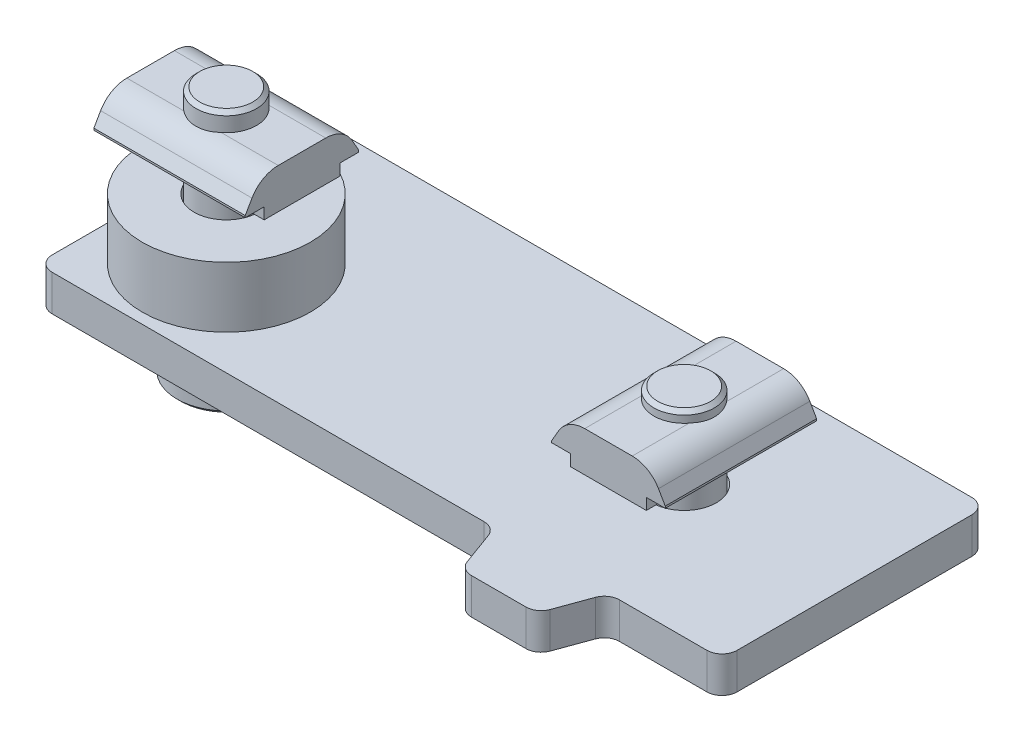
ISO-10303-21;
HEADER;
FILE_DESCRIPTION(('STEP AP214'),'2;1');
FILE_NAME('part.step','',(''),(''),'','','');
FILE_SCHEMA(('AUTOMOTIVE_DESIGN { 1 0 10303 214 1 1 1 1 }'));
ENDSEC;
DATA;
#1=APPLICATION_CONTEXT('core data for automotive mechanical design processes');
#2=APPLICATION_PROTOCOL_DEFINITION('international standard','automotive_design',2000,#1);
#3=PRODUCT_CONTEXT('',#1,'mechanical');
#4=PRODUCT('Part','Part','',(#3));
#5=PRODUCT_RELATED_PRODUCT_CATEGORY('part','',(#4));
#6=PRODUCT_DEFINITION_FORMATION('','',#4);
#7=PRODUCT_DEFINITION_CONTEXT('part definition',#1,'design');
#8=PRODUCT_DEFINITION('design','',#6,#7);
#9=PRODUCT_DEFINITION_SHAPE('','',#8);
#10=(LENGTH_UNIT() NAMED_UNIT(*) SI_UNIT(.MILLI.,.METRE.));
#11=(NAMED_UNIT(*) PLANE_ANGLE_UNIT() SI_UNIT($,.RADIAN.));
#12=(NAMED_UNIT(*) SI_UNIT($,.STERADIAN.) SOLID_ANGLE_UNIT());
#13=UNCERTAINTY_MEASURE_WITH_UNIT(LENGTH_MEASURE(1.E-05),#10,'distance_accuracy_value','');
#14=(GEOMETRIC_REPRESENTATION_CONTEXT(3) GLOBAL_UNCERTAINTY_ASSIGNED_CONTEXT((#13)) GLOBAL_UNIT_ASSIGNED_CONTEXT((#10,
#11,#12)) REPRESENTATION_CONTEXT('',''));
#15=CARTESIAN_POINT('',(0.,0.,0.));
#16=DIRECTION('',(0.,0.,1.));
#17=DIRECTION('',(1.,0.,0.));
#18=AXIS2_PLACEMENT_3D('',#15,#16,#17);
#19=CARTESIAN_POINT('',(-201.,7.99999999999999,145.5));
#20=DIRECTION('',(0.,1.,0.));
#21=DIRECTION('',(0.,0.,1.));
#22=AXIS2_PLACEMENT_3D('',#19,#20,#21);
#23=PLANE('',#22);
#24=CARTESIAN_POINT('',(-201.,7.99999999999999,145.5));
#25=DIRECTION('',(0.,1.,0.));
#26=DIRECTION('',(0.,0.,1.));
#27=AXIS2_PLACEMENT_3D('',#24,#25,#26);
#28=CIRCLE('',#27,11.1125);
#29=CARTESIAN_POINT('',(-201.,7.99999999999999,156.6125));
#30=VERTEX_POINT('',#29);
#31=EDGE_CURVE('P0_E10',#30,#30,#28,.T.);
#32=ORIENTED_EDGE('',*,*,#31,.T.);
#33=EDGE_LOOP('',(#32));
#34=FACE_BOUND('',#33,.T.);
#35=CARTESIAN_POINT('',(-201.,7.99999999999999,145.5));
#36=DIRECTION('',(0.,1.,0.));
#37=DIRECTION('',(0.,0.,1.));
#38=AXIS2_PLACEMENT_3D('',#35,#36,#37);
#39=CIRCLE('',#38,4.25);
#40=CARTESIAN_POINT('',(-201.,7.99999999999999,149.75));
#41=VERTEX_POINT('',#40);
#42=EDGE_CURVE('P0_E45',#41,#41,#39,.T.);
#43=ORIENTED_EDGE('',*,*,#42,.F.);
#44=EDGE_LOOP('',(#43));
#45=FACE_BOUND('',#44,.T.);
#46=ADVANCED_FACE('P0_F34',(#34,#45),#23,.T.);
#47=CARTESIAN_POINT('',(-201.,0.,145.5));
#48=DIRECTION('',(0.,1.,0.));
#49=DIRECTION('',(0.,0.,1.));
#50=AXIS2_PLACEMENT_3D('',#47,#48,#49);
#51=PLANE('',#50);
#52=CARTESIAN_POINT('',(-201.,0.,145.5));
#53=DIRECTION('',(0.,1.,0.));
#54=DIRECTION('',(0.,0.,1.));
#55=AXIS2_PLACEMENT_3D('',#52,#53,#54);
#56=CIRCLE('',#55,11.1125);
#57=CARTESIAN_POINT('',(-201.,0.,156.6125));
#58=VERTEX_POINT('',#57);
#59=EDGE_CURVE('P0_E38',#58,#58,#56,.T.);
#60=ORIENTED_EDGE('',*,*,#59,.F.);
#61=EDGE_LOOP('',(#60));
#62=FACE_BOUND('',#61,.T.);
#63=CARTESIAN_POINT('',(-201.,0.,145.5));
#64=DIRECTION('',(0.,1.,0.));
#65=DIRECTION('',(0.,0.,1.));
#66=AXIS2_PLACEMENT_3D('',#63,#64,#65);
#67=CIRCLE('',#66,4.25);
#68=CARTESIAN_POINT('',(-201.,0.,149.75));
#69=VERTEX_POINT('',#68);
#70=EDGE_CURVE('P0_E47',#69,#69,#67,.T.);
#71=ORIENTED_EDGE('',*,*,#70,.T.);
#72=EDGE_LOOP('',(#71));
#73=FACE_BOUND('',#72,.T.);
#74=ADVANCED_FACE('P0_F57',(#62,#73),#51,.F.);
#75=CARTESIAN_POINT('',(-201.,7.99999999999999,145.5));
#76=DIRECTION('',(0.,-1.,0.));
#77=DIRECTION('',(0.,0.,-1.));
#78=AXIS2_PLACEMENT_3D('',#75,#76,#77);
#79=CYLINDRICAL_SURFACE('',#78,11.1125);
#80=ORIENTED_EDGE('',*,*,#31,.F.);
#81=EDGE_LOOP('',(#80));
#82=FACE_BOUND('',#81,.T.);
#83=ORIENTED_EDGE('',*,*,#59,.T.);
#84=EDGE_LOOP('',(#83));
#85=FACE_BOUND('',#84,.T.);
#86=ADVANCED_FACE('P0_F36',(#82,#85),#79,.T.);
#87=CARTESIAN_POINT('',(-201.,7.99999999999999,145.5));
#88=DIRECTION('',(0.,-1.,0.));
#89=DIRECTION('',(0.,0.,-1.));
#90=AXIS2_PLACEMENT_3D('',#87,#88,#89);
#91=CYLINDRICAL_SURFACE('',#90,4.25);
#92=ORIENTED_EDGE('',*,*,#42,.T.);
#93=EDGE_LOOP('',(#92));
#94=FACE_BOUND('',#93,.T.);
#95=ORIENTED_EDGE('',*,*,#70,.F.);
#96=EDGE_LOOP('',(#95));
#97=FACE_BOUND('',#96,.T.);
#98=ADVANCED_FACE('P0_F53',(#94,#97),#91,.F.);
#99=CLOSED_SHELL('',(#46,#74,#86,#98));
#100=MANIFOLD_SOLID_BREP('P0_B2',#99);
#101=CARTESIAN_POINT('',(-123.,-4.76250000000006,158.));
#102=DIRECTION('',(0.,0.,-1.));
#103=DIRECTION('',(1.,0.,0.));
#104=AXIS2_PLACEMENT_3D('',#101,#102,#103);
#105=PLANE('',#104);
#106=DIRECTION('',(-1.,0.,0.));
#107=VECTOR('',#106,1.);
#108=CARTESIAN_POINT('',(-123.,-4.76250000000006,158.));
#109=LINE('',#108,#107);
#110=CARTESIAN_POINT('',(-154.448206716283,-4.76250000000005,158.));
#111=VERTEX_POINT('',#110);
#112=CARTESIAN_POINT('',(-211.5,-4.76250000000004,158.));
#113=VERTEX_POINT('',#112);
#114=EDGE_CURVE('P1_E253',#111,#113,#109,.T.);
#115=ORIENTED_EDGE('',*,*,#114,.F.);
#116=DIRECTION('',(0.,-1.,0.));
#117=VECTOR('',#116,1.);
#118=CARTESIAN_POINT('',(-154.448206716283,-4.76250000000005,158.));
#119=LINE('',#118,#117);
#120=CARTESIAN_POINT('',(-154.448206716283,0.,158.));
#121=VERTEX_POINT('',#120);
#122=EDGE_CURVE('P1_E206',#111,#121,#119,.F.);
#123=ORIENTED_EDGE('',*,*,#122,.T.);
#124=DIRECTION('',(-1.,0.,0.));
#125=VECTOR('',#124,1.);
#126=CARTESIAN_POINT('',(-123.,0.,158.));
#127=LINE('',#126,#125);
#128=CARTESIAN_POINT('',(-211.5,0.,158.));
#129=VERTEX_POINT('',#128);
#130=EDGE_CURVE('P1_E157',#121,#129,#127,.T.);
#131=ORIENTED_EDGE('',*,*,#130,.T.);
#132=DIRECTION('',(0.,1.,0.));
#133=VECTOR('',#132,1.);
#134=CARTESIAN_POINT('',(-211.5,-4.76250000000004,158.));
#135=LINE('',#134,#133);
#136=EDGE_CURVE('P1_E195',#129,#113,#135,.F.);
#137=ORIENTED_EDGE('',*,*,#136,.T.);
#138=EDGE_LOOP('',(#115,#123,#131,#137));
#139=FACE_BOUND('',#138,.T.);
#140=ADVANCED_FACE('P1_F16',(#139),#105,.F.);
#141=CARTESIAN_POINT('',(-123.,-4.76250000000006,158.));
#142=DIRECTION('',(0.,-1.,0.));
#143=DIRECTION('',(0.,0.,1.));
#144=AXIS2_PLACEMENT_3D('',#141,#142,#143);
#145=PLANE('',#144);
#146=CARTESIAN_POINT('',(-145.5,-4.76250000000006,140.5));
#147=DIRECTION('',(0.,-1.,0.));
#148=DIRECTION('',(0.,0.,1.));
#149=AXIS2_PLACEMENT_3D('',#146,#147,#148);
#150=CIRCLE('',#149,4.25);
#151=CARTESIAN_POINT('',(-145.5,-4.76250000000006,144.75));
#152=VERTEX_POINT('',#151);
#153=EDGE_CURVE('P1_E158',#152,#152,#150,.T.);
#154=ORIENTED_EDGE('',*,*,#153,.F.);
#155=EDGE_LOOP('',(#154));
#156=FACE_BOUND('',#155,.T.);
#157=DIRECTION('',(-1.,0.,0.));
#158=VECTOR('',#157,1.);
#159=CARTESIAN_POINT('',(-140.5,-4.76250000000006,165.));
#160=LINE('',#159,#158);
#161=CARTESIAN_POINT('',(-141.900415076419,-4.76250000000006,165.));
#162=VERTEX_POINT('',#161);
#163=CARTESIAN_POINT('',(-149.099584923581,-4.76250000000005,165.));
#164=VERTEX_POINT('',#163);
#165=EDGE_CURVE('P1_E244',#162,#164,#160,.T.);
#166=ORIENTED_EDGE('',*,*,#165,.T.);
#167=CARTESIAN_POINT('',(-149.099584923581,-4.76250000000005,163.));
#168=DIRECTION('',(0.,-1.,0.));
#169=DIRECTION('',(0.,0.,1.));
#170=AXIS2_PLACEMENT_3D('',#167,#168,#169);
#171=CIRCLE('',#170,2.);
#172=CARTESIAN_POINT('',(-150.978970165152,-4.76250000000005,163.684040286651));
#173=VERTEX_POINT('',#172);
#174=EDGE_CURVE('P1_E215',#164,#173,#171,.T.);
#175=ORIENTED_EDGE('',*,*,#174,.T.);
#176=DIRECTION('',(-0.342020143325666,0.,-0.939692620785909));
#177=VECTOR('',#176,1.);
#178=CARTESIAN_POINT('',(-150.5,-4.76250000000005,165.));
#179=LINE('',#178,#177);
#180=CARTESIAN_POINT('',(-152.568821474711,-4.76250000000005,159.315959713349));
#181=VERTEX_POINT('',#180);
#182=EDGE_CURVE('P1_E288',#173,#181,#179,.T.);
#183=ORIENTED_EDGE('',*,*,#182,.T.);
#184=CARTESIAN_POINT('',(-154.448206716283,-4.76250000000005,160.));
#185=DIRECTION('',(0.,-1.,0.));
#186=DIRECTION('',(0.,0.,1.));
#187=AXIS2_PLACEMENT_3D('',#184,#185,#186);
#188=CIRCLE('',#187,2.);
#189=EDGE_CURVE('P1_E228',#181,#111,#188,.F.);
#190=ORIENTED_EDGE('',*,*,#189,.T.);
#191=ORIENTED_EDGE('',*,*,#114,.T.);
#192=CARTESIAN_POINT('',(-211.5,-4.76250000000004,156.));
#193=DIRECTION('',(0.,-1.,0.));
#194=DIRECTION('',(0.,0.,1.));
#195=AXIS2_PLACEMENT_3D('',#192,#193,#194);
#196=CIRCLE('',#195,2.);
#197=CARTESIAN_POINT('',(-213.5,-4.76250000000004,156.));
#198=VERTEX_POINT('',#197);
#199=EDGE_CURVE('P1_E182',#113,#198,#196,.T.);
#200=ORIENTED_EDGE('',*,*,#199,.T.);
#201=DIRECTION('',(0.,0.,-1.));
#202=VECTOR('',#201,1.);
#203=CARTESIAN_POINT('',(-213.5,-4.76250000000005,123.));
#204=LINE('',#203,#202);
#205=CARTESIAN_POINT('',(-213.5,-4.76250000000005,125.));
#206=VERTEX_POINT('',#205);
#207=EDGE_CURVE('P1_E257',#198,#206,#204,.T.);
#208=ORIENTED_EDGE('',*,*,#207,.T.);
#209=CARTESIAN_POINT('',(-211.5,-4.76250000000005,125.));
#210=DIRECTION('',(0.,-1.,0.));
#211=DIRECTION('',(0.,0.,1.));
#212=AXIS2_PLACEMENT_3D('',#209,#210,#211);
#213=CIRCLE('',#212,2.);
#214=CARTESIAN_POINT('',(-211.5,-4.76250000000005,123.));
#215=VERTEX_POINT('',#214);
#216=EDGE_CURVE('P1_E186',#206,#215,#213,.T.);
#217=ORIENTED_EDGE('',*,*,#216,.T.);
#218=DIRECTION('',(1.,0.,0.));
#219=VECTOR('',#218,1.);
#220=CARTESIAN_POINT('',(-123.,-4.76250000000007,123.));
#221=LINE('',#220,#219);
#222=CARTESIAN_POINT('',(-125.,-4.76250000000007,123.));
#223=VERTEX_POINT('',#222);
#224=EDGE_CURVE('P1_E166',#215,#223,#221,.T.);
#225=ORIENTED_EDGE('',*,*,#224,.T.);
#226=CARTESIAN_POINT('',(-125.,-4.76250000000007,125.));
#227=DIRECTION('',(0.,-1.,0.));
#228=DIRECTION('',(0.,0.,1.));
#229=AXIS2_PLACEMENT_3D('',#226,#227,#228);
#230=CIRCLE('',#229,2.);
#231=CARTESIAN_POINT('',(-123.,-4.76250000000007,125.));
#232=VERTEX_POINT('',#231);
#233=EDGE_CURVE('P1_E188',#223,#232,#230,.T.);
#234=ORIENTED_EDGE('',*,*,#233,.T.);
#235=DIRECTION('',(0.,0.,1.));
#236=VECTOR('',#235,1.);
#237=CARTESIAN_POINT('',(-123.,-4.76250000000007,123.));
#238=LINE('',#237,#236);
#239=CARTESIAN_POINT('',(-123.,-4.76250000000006,156.));
#240=VERTEX_POINT('',#239);
#241=EDGE_CURVE('P1_E149',#232,#240,#238,.T.);
#242=ORIENTED_EDGE('',*,*,#241,.T.);
#243=CARTESIAN_POINT('',(-125.,-4.76250000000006,156.));
#244=DIRECTION('',(0.,-1.,0.));
#245=DIRECTION('',(0.,0.,1.));
#246=AXIS2_PLACEMENT_3D('',#243,#244,#245);
#247=CIRCLE('',#246,2.);
#248=CARTESIAN_POINT('',(-125.,-4.76250000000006,158.));
#249=VERTEX_POINT('',#248);
#250=EDGE_CURVE('P1_E184',#240,#249,#247,.T.);
#251=ORIENTED_EDGE('',*,*,#250,.T.);
#252=CARTESIAN_POINT('',(-136.551793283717,-4.76250000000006,158.));
#253=VERTEX_POINT('',#252);
#254=EDGE_CURVE('P1_E239',#249,#253,#109,.T.);
#255=ORIENTED_EDGE('',*,*,#254,.T.);
#256=CARTESIAN_POINT('',(-136.551793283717,-4.76250000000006,160.));
#257=DIRECTION('',(0.,-1.,0.));
#258=DIRECTION('',(0.,0.,1.));
#259=AXIS2_PLACEMENT_3D('',#256,#257,#258);
#260=CIRCLE('',#259,2.);
#261=CARTESIAN_POINT('',(-138.431178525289,-4.76250000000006,159.315959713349));
#262=VERTEX_POINT('',#261);
#263=EDGE_CURVE('P1_E24',#253,#262,#260,.F.);
#264=ORIENTED_EDGE('',*,*,#263,.T.);
#265=DIRECTION('',(-0.342020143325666,0.,0.939692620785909));
#266=VECTOR('',#265,1.);
#267=CARTESIAN_POINT('',(-137.952208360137,-4.76250000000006,158.));
#268=LINE('',#267,#266);
#269=CARTESIAN_POINT('',(-140.021029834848,-4.76250000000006,163.684040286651));
#270=VERTEX_POINT('',#269);
#271=EDGE_CURVE('P1_E237',#262,#270,#268,.T.);
#272=ORIENTED_EDGE('',*,*,#271,.T.);
#273=CARTESIAN_POINT('',(-141.900415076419,-4.76250000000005,163.));
#274=DIRECTION('',(0.,-1.,0.));
#275=DIRECTION('',(0.,0.,1.));
#276=AXIS2_PLACEMENT_3D('',#273,#274,#275);
#277=CIRCLE('',#276,2.);
#278=EDGE_CURVE('P1_E213',#270,#162,#277,.T.);
#279=ORIENTED_EDGE('',*,*,#278,.T.);
#280=EDGE_LOOP('',(#166,#175,#183,#190,#191,#200,#208,#217,#225,#234,#242,#251,#255,#264,#272,#279));
#281=FACE_BOUND('',#280,.T.);
#282=CARTESIAN_POINT('',(-201.,-4.76250000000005,145.5));
#283=DIRECTION('',(0.,-1.,0.));
#284=DIRECTION('',(0.,0.,1.));
#285=AXIS2_PLACEMENT_3D('',#282,#283,#284);
#286=CIRCLE('',#285,4.25000000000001);
#287=CARTESIAN_POINT('',(-201.,-4.76250000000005,149.75));
#288=VERTEX_POINT('',#287);
#289=EDGE_CURVE('P1_E301',#288,#288,#286,.T.);
#290=ORIENTED_EDGE('',*,*,#289,.F.);
#291=EDGE_LOOP('',(#290));
#292=FACE_BOUND('',#291,.T.);
#293=ADVANCED_FACE('P1_F235',(#156,#281,#292),#145,.T.);
#294=CARTESIAN_POINT('',(-123.,0.,158.));
#295=DIRECTION('',(0.,-1.,0.));
#296=DIRECTION('',(0.,0.,1.));
#297=AXIS2_PLACEMENT_3D('',#294,#295,#296);
#298=PLANE('',#297);
#299=CARTESIAN_POINT('',(-145.5,0.,140.5));
#300=DIRECTION('',(0.,-1.,0.));
#301=DIRECTION('',(0.,0.,1.));
#302=AXIS2_PLACEMENT_3D('',#299,#300,#301);
#303=CIRCLE('',#302,4.25);
#304=CARTESIAN_POINT('',(-145.5,0.,144.75));
#305=VERTEX_POINT('',#304);
#306=EDGE_CURVE('P1_E163',#305,#305,#303,.T.);
#307=ORIENTED_EDGE('',*,*,#306,.T.);
#308=EDGE_LOOP('',(#307));
#309=FACE_BOUND('',#308,.T.);
#310=DIRECTION('',(0.342020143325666,0.,0.93969262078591));
#311=VECTOR('',#310,1.);
#312=CARTESIAN_POINT('',(-150.5,0.,165.));
#313=LINE('',#312,#311);
#314=CARTESIAN_POINT('',(-152.568821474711,0.,159.315959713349));
#315=VERTEX_POINT('',#314);
#316=CARTESIAN_POINT('',(-150.978970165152,0.,163.684040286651));
#317=VERTEX_POINT('',#316);
#318=EDGE_CURVE('P1_E290',#315,#317,#313,.T.);
#319=ORIENTED_EDGE('',*,*,#318,.T.);
#320=CARTESIAN_POINT('',(-149.099584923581,0.,163.));
#321=DIRECTION('',(0.,-1.,0.));
#322=DIRECTION('',(0.,0.,1.));
#323=AXIS2_PLACEMENT_3D('',#320,#321,#322);
#324=CIRCLE('',#323,2.);
#325=CARTESIAN_POINT('',(-149.099584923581,0.,165.));
#326=VERTEX_POINT('',#325);
#327=EDGE_CURVE('P1_E219',#317,#326,#324,.F.);
#328=ORIENTED_EDGE('',*,*,#327,.T.);
#329=DIRECTION('',(1.,0.,0.));
#330=VECTOR('',#329,1.);
#331=CARTESIAN_POINT('',(-140.5,0.,165.));
#332=LINE('',#331,#330);
#333=CARTESIAN_POINT('',(-141.900415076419,0.,165.));
#334=VERTEX_POINT('',#333);
#335=EDGE_CURVE('P1_E292',#326,#334,#332,.T.);
#336=ORIENTED_EDGE('',*,*,#335,.T.);
#337=CARTESIAN_POINT('',(-141.900415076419,0.,163.));
#338=DIRECTION('',(0.,-1.,0.));
#339=DIRECTION('',(0.,0.,1.));
#340=AXIS2_PLACEMENT_3D('',#337,#338,#339);
#341=CIRCLE('',#340,2.);
#342=CARTESIAN_POINT('',(-140.021029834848,0.,163.684040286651));
#343=VERTEX_POINT('',#342);
#344=EDGE_CURVE('P1_E217',#334,#343,#341,.F.);
#345=ORIENTED_EDGE('',*,*,#344,.T.);
#346=DIRECTION('',(0.342020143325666,0.,-0.93969262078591));
#347=VECTOR('',#346,1.);
#348=CARTESIAN_POINT('',(-137.952208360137,0.,158.));
#349=LINE('',#348,#347);
#350=CARTESIAN_POINT('',(-138.431178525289,0.,159.315959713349));
#351=VERTEX_POINT('',#350);
#352=EDGE_CURVE('P1_E298',#343,#351,#349,.T.);
#353=ORIENTED_EDGE('',*,*,#352,.T.);
#354=CARTESIAN_POINT('',(-136.551793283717,0.,160.));
#355=DIRECTION('',(0.,-1.,0.));
#356=DIRECTION('',(0.,0.,1.));
#357=AXIS2_PLACEMENT_3D('',#354,#355,#356);
#358=CIRCLE('',#357,2.);
#359=CARTESIAN_POINT('',(-136.551793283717,0.,158.));
#360=VERTEX_POINT('',#359);
#361=EDGE_CURVE('P1_E11',#351,#360,#358,.T.);
#362=ORIENTED_EDGE('',*,*,#361,.T.);
#363=CARTESIAN_POINT('',(-125.,0.,158.));
#364=VERTEX_POINT('',#363);
#365=EDGE_CURVE('P1_E160',#364,#360,#127,.T.);
#366=ORIENTED_EDGE('',*,*,#365,.F.);
#367=CARTESIAN_POINT('',(-125.,0.,156.));
#368=DIRECTION('',(0.,-1.,0.));
#369=DIRECTION('',(0.,0.,1.));
#370=AXIS2_PLACEMENT_3D('',#367,#368,#369);
#371=CIRCLE('',#370,2.);
#372=CARTESIAN_POINT('',(-123.,0.,156.));
#373=VERTEX_POINT('',#372);
#374=EDGE_CURVE('P1_E156',#364,#373,#371,.F.);
#375=ORIENTED_EDGE('',*,*,#374,.T.);
#376=DIRECTION('',(0.,0.,1.));
#377=VECTOR('',#376,1.);
#378=CARTESIAN_POINT('',(-123.,0.,123.));
#379=LINE('',#378,#377);
#380=CARTESIAN_POINT('',(-123.,0.,125.));
#381=VERTEX_POINT('',#380);
#382=EDGE_CURVE('P1_E146',#381,#373,#379,.T.);
#383=ORIENTED_EDGE('',*,*,#382,.F.);
#384=CARTESIAN_POINT('',(-125.,0.,125.));
#385=DIRECTION('',(0.,-1.,0.));
#386=DIRECTION('',(0.,0.,1.));
#387=AXIS2_PLACEMENT_3D('',#384,#385,#386);
#388=CIRCLE('',#387,2.);
#389=CARTESIAN_POINT('',(-125.,0.,123.));
#390=VERTEX_POINT('',#389);
#391=EDGE_CURVE('P1_E130',#381,#390,#388,.F.);
#392=ORIENTED_EDGE('',*,*,#391,.T.);
#393=DIRECTION('',(1.,0.,0.));
#394=VECTOR('',#393,1.);
#395=CARTESIAN_POINT('',(-123.,0.,123.));
#396=LINE('',#395,#394);
#397=CARTESIAN_POINT('',(-211.5,0.,123.));
#398=VERTEX_POINT('',#397);
#399=EDGE_CURVE('P1_E172',#398,#390,#396,.T.);
#400=ORIENTED_EDGE('',*,*,#399,.F.);
#401=CARTESIAN_POINT('',(-211.5,0.,125.));
#402=DIRECTION('',(0.,-1.,0.));
#403=DIRECTION('',(0.,0.,1.));
#404=AXIS2_PLACEMENT_3D('',#401,#402,#403);
#405=CIRCLE('',#404,2.);
#406=CARTESIAN_POINT('',(-213.5,0.,125.));
#407=VERTEX_POINT('',#406);
#408=EDGE_CURVE('P1_E140',#398,#407,#405,.F.);
#409=ORIENTED_EDGE('',*,*,#408,.T.);
#410=DIRECTION('',(0.,0.,-1.));
#411=VECTOR('',#410,1.);
#412=CARTESIAN_POINT('',(-213.5,0.,123.));
#413=LINE('',#412,#411);
#414=CARTESIAN_POINT('',(-213.5,0.,156.));
#415=VERTEX_POINT('',#414);
#416=EDGE_CURVE('P1_E169',#415,#407,#413,.T.);
#417=ORIENTED_EDGE('',*,*,#416,.F.);
#418=CARTESIAN_POINT('',(-211.5,0.,156.));
#419=DIRECTION('',(0.,-1.,0.));
#420=DIRECTION('',(0.,0.,1.));
#421=AXIS2_PLACEMENT_3D('',#418,#419,#420);
#422=CIRCLE('',#421,2.);
#423=EDGE_CURVE('P1_E150',#415,#129,#422,.F.);
#424=ORIENTED_EDGE('',*,*,#423,.T.);
#425=ORIENTED_EDGE('',*,*,#130,.F.);
#426=CARTESIAN_POINT('',(-154.448206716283,0.,160.));
#427=DIRECTION('',(0.,-1.,0.));
#428=DIRECTION('',(0.,0.,1.));
#429=AXIS2_PLACEMENT_3D('',#426,#427,#428);
#430=CIRCLE('',#429,2.);
#431=EDGE_CURVE('P1_E230',#121,#315,#430,.T.);
#432=ORIENTED_EDGE('',*,*,#431,.T.);
#433=EDGE_LOOP('',(#319,#328,#336,#345,#353,#362,#366,#375,#383,#392,#400,#409,#417,#424,#425,#432));
#434=FACE_BOUND('',#433,.T.);
#435=CARTESIAN_POINT('',(-201.,0.,145.5));
#436=DIRECTION('',(0.,-1.,0.));
#437=DIRECTION('',(0.,0.,1.));
#438=AXIS2_PLACEMENT_3D('',#435,#436,#437);
#439=CIRCLE('',#438,4.25000000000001);
#440=CARTESIAN_POINT('',(-201.,0.,149.75));
#441=VERTEX_POINT('',#440);
#442=EDGE_CURVE('P1_E300',#441,#441,#439,.T.);
#443=ORIENTED_EDGE('',*,*,#442,.T.);
#444=EDGE_LOOP('',(#443));
#445=FACE_BOUND('',#444,.T.);
#446=ADVANCED_FACE('P1_F154',(#309,#434,#445),#298,.F.);
#447=CARTESIAN_POINT('',(-123.,-4.76250000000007,123.));
#448=DIRECTION('',(-1.,0.,0.));
#449=DIRECTION('',(0.,0.,-1.));
#450=AXIS2_PLACEMENT_3D('',#447,#448,#449);
#451=PLANE('',#450);
#452=ORIENTED_EDGE('',*,*,#241,.F.);
#453=DIRECTION('',(0.,1.,0.));
#454=VECTOR('',#453,1.);
#455=CARTESIAN_POINT('',(-123.,-4.76250000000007,125.));
#456=LINE('',#455,#454);
#457=EDGE_CURVE('P1_E134',#232,#381,#456,.T.);
#458=ORIENTED_EDGE('',*,*,#457,.T.);
#459=ORIENTED_EDGE('',*,*,#382,.T.);
#460=DIRECTION('',(0.,1.,0.));
#461=VECTOR('',#460,1.);
#462=CARTESIAN_POINT('',(-123.,-4.76250000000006,156.));
#463=LINE('',#462,#461);
#464=EDGE_CURVE('P1_E151',#373,#240,#463,.F.);
#465=ORIENTED_EDGE('',*,*,#464,.T.);
#466=EDGE_LOOP('',(#452,#458,#459,#465));
#467=FACE_BOUND('',#466,.T.);
#468=ADVANCED_FACE('P1_F145',(#467),#451,.F.);
#469=ORIENTED_EDGE('',*,*,#365,.T.);
#470=DIRECTION('',(0.,-1.,0.));
#471=VECTOR('',#470,1.);
#472=CARTESIAN_POINT('',(-136.551793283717,-4.76250000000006,158.));
#473=LINE('',#472,#471);
#474=EDGE_CURVE('P1_E225',#360,#253,#473,.T.);
#475=ORIENTED_EDGE('',*,*,#474,.T.);
#476=ORIENTED_EDGE('',*,*,#254,.F.);
#477=DIRECTION('',(0.,1.,0.));
#478=VECTOR('',#477,1.);
#479=CARTESIAN_POINT('',(-125.,-4.76250000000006,158.));
#480=LINE('',#479,#478);
#481=EDGE_CURVE('P1_E198',#249,#364,#480,.T.);
#482=ORIENTED_EDGE('',*,*,#481,.T.);
#483=EDGE_LOOP('',(#469,#475,#476,#482));
#484=FACE_BOUND('',#483,.T.);
#485=ADVANCED_FACE('P1_F247',(#484),#105,.F.);
#486=CARTESIAN_POINT('',(-213.5,-4.76250000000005,123.));
#487=DIRECTION('',(1.,0.,0.));
#488=DIRECTION('',(0.,0.,1.));
#489=AXIS2_PLACEMENT_3D('',#486,#487,#488);
#490=PLANE('',#489);
#491=ORIENTED_EDGE('',*,*,#416,.T.);
#492=DIRECTION('',(0.,1.,0.));
#493=VECTOR('',#492,1.);
#494=CARTESIAN_POINT('',(-213.5,-4.76250000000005,125.));
#495=LINE('',#494,#493);
#496=EDGE_CURVE('P1_E193',#407,#206,#495,.F.);
#497=ORIENTED_EDGE('',*,*,#496,.T.);
#498=ORIENTED_EDGE('',*,*,#207,.F.);
#499=DIRECTION('',(0.,1.,0.));
#500=VECTOR('',#499,1.);
#501=CARTESIAN_POINT('',(-213.5,-4.76250000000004,156.));
#502=LINE('',#501,#500);
#503=EDGE_CURVE('P1_E190',#198,#415,#502,.T.);
#504=ORIENTED_EDGE('',*,*,#503,.T.);
#505=EDGE_LOOP('',(#491,#497,#498,#504));
#506=FACE_BOUND('',#505,.T.);
#507=ADVANCED_FACE('P1_F270',(#506),#490,.F.);
#508=CARTESIAN_POINT('',(-123.,-4.76250000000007,123.));
#509=DIRECTION('',(0.,0.,1.));
#510=DIRECTION('',(-1.,0.,0.));
#511=AXIS2_PLACEMENT_3D('',#508,#509,#510);
#512=PLANE('',#511);
#513=ORIENTED_EDGE('',*,*,#399,.T.);
#514=DIRECTION('',(0.,1.,0.));
#515=VECTOR('',#514,1.);
#516=CARTESIAN_POINT('',(-125.,-4.76250000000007,123.));
#517=LINE('',#516,#515);
#518=EDGE_CURVE('P1_E135',#390,#223,#517,.F.);
#519=ORIENTED_EDGE('',*,*,#518,.T.);
#520=ORIENTED_EDGE('',*,*,#224,.F.);
#521=DIRECTION('',(0.,1.,0.));
#522=VECTOR('',#521,1.);
#523=CARTESIAN_POINT('',(-211.5,-4.76250000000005,123.));
#524=LINE('',#523,#522);
#525=EDGE_CURVE('P1_E139',#215,#398,#524,.T.);
#526=ORIENTED_EDGE('',*,*,#525,.T.);
#527=EDGE_LOOP('',(#513,#519,#520,#526));
#528=FACE_BOUND('',#527,.T.);
#529=ADVANCED_FACE('P1_F264',(#528),#512,.F.);
#530=CARTESIAN_POINT('',(-145.5,-4.76250000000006,140.5));
#531=DIRECTION('',(0.,1.,0.));
#532=DIRECTION('',(0.,0.,-1.));
#533=AXIS2_PLACEMENT_3D('',#530,#531,#532);
#534=CYLINDRICAL_SURFACE('',#533,4.25);
#535=ORIENTED_EDGE('',*,*,#153,.T.);
#536=EDGE_LOOP('',(#535));
#537=FACE_BOUND('',#536,.T.);
#538=ORIENTED_EDGE('',*,*,#306,.F.);
#539=EDGE_LOOP('',(#538));
#540=FACE_BOUND('',#539,.T.);
#541=ADVANCED_FACE('P1_F309',(#537,#540),#534,.F.);
#542=CARTESIAN_POINT('',(-201.,-4.76250000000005,145.5));
#543=DIRECTION('',(0.,1.,0.));
#544=DIRECTION('',(0.,0.,-1.));
#545=AXIS2_PLACEMENT_3D('',#542,#543,#544);
#546=CYLINDRICAL_SURFACE('',#545,4.25000000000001);
#547=ORIENTED_EDGE('',*,*,#289,.T.);
#548=EDGE_LOOP('',(#547));
#549=FACE_BOUND('',#548,.T.);
#550=ORIENTED_EDGE('',*,*,#442,.F.);
#551=EDGE_LOOP('',(#550));
#552=FACE_BOUND('',#551,.T.);
#553=ADVANCED_FACE('P1_F307',(#549,#552),#546,.F.);
#554=CARTESIAN_POINT('',(-125.,-4.76250000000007,125.));
#555=DIRECTION('',(0.,1.,0.));
#556=DIRECTION('',(0.,0.,-1.));
#557=AXIS2_PLACEMENT_3D('',#554,#555,#556);
#558=CYLINDRICAL_SURFACE('',#557,2.);
#559=ORIENTED_EDGE('',*,*,#233,.F.);
#560=ORIENTED_EDGE('',*,*,#518,.F.);
#561=ORIENTED_EDGE('',*,*,#391,.F.);
#562=ORIENTED_EDGE('',*,*,#457,.F.);
#563=EDGE_LOOP('',(#559,#560,#561,#562));
#564=FACE_BOUND('',#563,.T.);
#565=ADVANCED_FACE('P1_F133',(#564),#558,.T.);
#566=CARTESIAN_POINT('',(-211.5,-4.76250000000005,125.));
#567=DIRECTION('',(0.,1.,0.));
#568=DIRECTION('',(0.,0.,-1.));
#569=AXIS2_PLACEMENT_3D('',#566,#567,#568);
#570=CYLINDRICAL_SURFACE('',#569,2.);
#571=ORIENTED_EDGE('',*,*,#216,.F.);
#572=ORIENTED_EDGE('',*,*,#496,.F.);
#573=ORIENTED_EDGE('',*,*,#408,.F.);
#574=ORIENTED_EDGE('',*,*,#525,.F.);
#575=EDGE_LOOP('',(#571,#572,#573,#574));
#576=FACE_BOUND('',#575,.T.);
#577=ADVANCED_FACE('P1_F266',(#576),#570,.T.);
#578=CARTESIAN_POINT('',(-125.,-4.76250000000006,156.));
#579=DIRECTION('',(0.,1.,0.));
#580=DIRECTION('',(0.,0.,-1.));
#581=AXIS2_PLACEMENT_3D('',#578,#579,#580);
#582=CYLINDRICAL_SURFACE('',#581,2.);
#583=ORIENTED_EDGE('',*,*,#250,.F.);
#584=ORIENTED_EDGE('',*,*,#464,.F.);
#585=ORIENTED_EDGE('',*,*,#374,.F.);
#586=ORIENTED_EDGE('',*,*,#481,.F.);
#587=EDGE_LOOP('',(#583,#584,#585,#586));
#588=FACE_BOUND('',#587,.T.);
#589=ADVANCED_FACE('P1_F251',(#588),#582,.T.);
#590=CARTESIAN_POINT('',(-211.5,-4.76250000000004,156.));
#591=DIRECTION('',(0.,1.,0.));
#592=DIRECTION('',(0.,0.,-1.));
#593=AXIS2_PLACEMENT_3D('',#590,#591,#592);
#594=CYLINDRICAL_SURFACE('',#593,2.);
#595=ORIENTED_EDGE('',*,*,#199,.F.);
#596=ORIENTED_EDGE('',*,*,#136,.F.);
#597=ORIENTED_EDGE('',*,*,#423,.F.);
#598=ORIENTED_EDGE('',*,*,#503,.F.);
#599=EDGE_LOOP('',(#595,#596,#597,#598));
#600=FACE_BOUND('',#599,.T.);
#601=ADVANCED_FACE('P1_F274',(#600),#594,.T.);
#602=CARTESIAN_POINT('',(-150.5,16.6396104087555,165.));
#603=DIRECTION('',(-0.939692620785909,0.,0.342020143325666));
#604=DIRECTION('',(-0.342020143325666,0.,-0.93969262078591));
#605=AXIS2_PLACEMENT_3D('',#602,#603,#604);
#606=PLANE('',#605);
#607=ORIENTED_EDGE('',*,*,#318,.F.);
#608=DIRECTION('',(0.,-1.,0.));
#609=VECTOR('',#608,1.);
#610=CARTESIAN_POINT('',(-152.568821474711,16.6396104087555,159.315959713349));
#611=LINE('',#610,#609);
#612=EDGE_CURVE('P1_E203',#315,#181,#611,.T.);
#613=ORIENTED_EDGE('',*,*,#612,.T.);
#614=ORIENTED_EDGE('',*,*,#182,.F.);
#615=DIRECTION('',(0.,-1.,0.));
#616=VECTOR('',#615,1.);
#617=CARTESIAN_POINT('',(-150.978970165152,16.6396104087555,163.684040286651));
#618=LINE('',#617,#616);
#619=EDGE_CURVE('P1_E201',#173,#317,#618,.F.);
#620=ORIENTED_EDGE('',*,*,#619,.T.);
#621=EDGE_LOOP('',(#607,#613,#614,#620));
#622=FACE_BOUND('',#621,.T.);
#623=ADVANCED_FACE('P1_F287',(#622),#606,.T.);
#624=CARTESIAN_POINT('',(-140.5,16.6396104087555,165.));
#625=DIRECTION('',(0.,0.,1.));
#626=DIRECTION('',(-1.,0.,0.));
#627=AXIS2_PLACEMENT_3D('',#624,#625,#626);
#628=PLANE('',#627);
#629=ORIENTED_EDGE('',*,*,#335,.F.);
#630=DIRECTION('',(0.,-1.,0.));
#631=VECTOR('',#630,1.);
#632=CARTESIAN_POINT('',(-149.099584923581,16.6396104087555,165.));
#633=LINE('',#632,#631);
#634=EDGE_CURVE('P1_E210',#326,#164,#633,.T.);
#635=ORIENTED_EDGE('',*,*,#634,.T.);
#636=ORIENTED_EDGE('',*,*,#165,.F.);
#637=DIRECTION('',(0.,-1.,0.));
#638=VECTOR('',#637,1.);
#639=CARTESIAN_POINT('',(-141.900415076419,16.6396104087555,165.));
#640=LINE('',#639,#638);
#641=EDGE_CURVE('P1_E208',#162,#334,#640,.F.);
#642=ORIENTED_EDGE('',*,*,#641,.T.);
#643=EDGE_LOOP('',(#629,#635,#636,#642));
#644=FACE_BOUND('',#643,.T.);
#645=ADVANCED_FACE('P1_F364',(#644),#628,.T.);
#646=CARTESIAN_POINT('',(-137.952208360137,16.6396104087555,158.));
#647=DIRECTION('',(0.939692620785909,0.,0.342020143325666));
#648=DIRECTION('',(-0.342020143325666,0.,0.93969262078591));
#649=AXIS2_PLACEMENT_3D('',#646,#647,#648);
#650=PLANE('',#649);
#651=ORIENTED_EDGE('',*,*,#352,.F.);
#652=DIRECTION('',(0.,-1.,0.));
#653=VECTOR('',#652,1.);
#654=CARTESIAN_POINT('',(-140.021029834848,16.6396104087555,163.684040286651));
#655=LINE('',#654,#653);
#656=EDGE_CURVE('P1_E222',#343,#270,#655,.T.);
#657=ORIENTED_EDGE('',*,*,#656,.T.);
#658=ORIENTED_EDGE('',*,*,#271,.F.);
#659=DIRECTION('',(0.,-1.,0.));
#660=VECTOR('',#659,1.);
#661=CARTESIAN_POINT('',(-138.431178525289,16.6396104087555,159.315959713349));
#662=LINE('',#661,#660);
#663=EDGE_CURVE('P1_E37',#262,#351,#662,.F.);
#664=ORIENTED_EDGE('',*,*,#663,.T.);
#665=EDGE_LOOP('',(#651,#657,#658,#664));
#666=FACE_BOUND('',#665,.T.);
#667=ADVANCED_FACE('P1_F242',(#666),#650,.T.);
#668=CARTESIAN_POINT('',(-154.448206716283,16.6396104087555,160.));
#669=DIRECTION('',(0.,-1.,0.));
#670=DIRECTION('',(0.,0.,1.));
#671=AXIS2_PLACEMENT_3D('',#668,#669,#670);
#672=CYLINDRICAL_SURFACE('',#671,2.);
#673=ORIENTED_EDGE('',*,*,#431,.F.);
#674=ORIENTED_EDGE('',*,*,#122,.F.);
#675=ORIENTED_EDGE('',*,*,#189,.F.);
#676=ORIENTED_EDGE('',*,*,#612,.F.);
#677=EDGE_LOOP('',(#673,#674,#675,#676));
#678=FACE_BOUND('',#677,.T.);
#679=ADVANCED_FACE('P1_F283',(#678),#672,.F.);
#680=CARTESIAN_POINT('',(-149.099584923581,16.6396104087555,163.));
#681=DIRECTION('',(0.,-1.,0.));
#682=DIRECTION('',(0.,0.,1.));
#683=AXIS2_PLACEMENT_3D('',#680,#681,#682);
#684=CYLINDRICAL_SURFACE('',#683,2.);
#685=ORIENTED_EDGE('',*,*,#327,.F.);
#686=ORIENTED_EDGE('',*,*,#619,.F.);
#687=ORIENTED_EDGE('',*,*,#174,.F.);
#688=ORIENTED_EDGE('',*,*,#634,.F.);
#689=EDGE_LOOP('',(#685,#686,#687,#688));
#690=FACE_BOUND('',#689,.T.);
#691=ADVANCED_FACE('P1_F349',(#690),#684,.T.);
#692=CARTESIAN_POINT('',(-141.900415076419,16.6396104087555,163.));
#693=DIRECTION('',(0.,-1.,0.));
#694=DIRECTION('',(0.,0.,1.));
#695=AXIS2_PLACEMENT_3D('',#692,#693,#694);
#696=CYLINDRICAL_SURFACE('',#695,2.);
#697=ORIENTED_EDGE('',*,*,#344,.F.);
#698=ORIENTED_EDGE('',*,*,#641,.F.);
#699=ORIENTED_EDGE('',*,*,#278,.F.);
#700=ORIENTED_EDGE('',*,*,#656,.F.);
#701=EDGE_LOOP('',(#697,#698,#699,#700));
#702=FACE_BOUND('',#701,.T.);
#703=ADVANCED_FACE('P1_F351',(#702),#696,.T.);
#704=CARTESIAN_POINT('',(-136.551793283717,-4.76250000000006,160.));
#705=DIRECTION('',(0.,-1.,0.));
#706=DIRECTION('',(0.,0.,1.));
#707=AXIS2_PLACEMENT_3D('',#704,#705,#706);
#708=CYLINDRICAL_SURFACE('',#707,2.);
#709=ORIENTED_EDGE('',*,*,#361,.F.);
#710=ORIENTED_EDGE('',*,*,#663,.F.);
#711=ORIENTED_EDGE('',*,*,#263,.F.);
#712=ORIENTED_EDGE('',*,*,#474,.F.);
#713=EDGE_LOOP('',(#709,#710,#711,#712));
#714=FACE_BOUND('',#713,.T.);
#715=ADVANCED_FACE('P1_F18',(#714),#708,.F.);
#716=CLOSED_SHELL('',(#140,#293,#446,#468,#485,#507,#529,#541,#553,#565,#577,#589,#601,#623,
#645,#667,#679,#691,#703,#715));
#717=MANIFOLD_SOLID_BREP('P1_B1',#716);
#718=CARTESIAN_POINT('',(-201.,20.2375,149.5));
#719=DIRECTION('',(0.,1.,0.));
#720=DIRECTION('',(0.,0.,1.));
#721=AXIS2_PLACEMENT_3D('',#718,#719,#720);
#722=PLANE('',#721);
#723=CARTESIAN_POINT('',(-201.,20.2375,145.5));
#724=DIRECTION('',(0.,1.,0.));
#725=DIRECTION('',(0.,0.,1.));
#726=AXIS2_PLACEMENT_3D('',#723,#724,#725);
#727=CIRCLE('',#726,3.5);
#728=CARTESIAN_POINT('',(-201.,20.2375,149.));
#729=VERTEX_POINT('',#728);
#730=EDGE_CURVE('P2_E139',#729,#729,#727,.T.);
#731=ORIENTED_EDGE('',*,*,#730,.T.);
#732=EDGE_LOOP('',(#731));
#733=FACE_BOUND('',#732,.T.);
#734=ADVANCED_FACE('P2_F16',(#733),#722,.T.);
#735=CARTESIAN_POINT('',(-201.,-12.7625,145.5));
#736=DIRECTION('',(0.,1.,0.));
#737=DIRECTION('',(0.,0.,1.));
#738=AXIS2_PLACEMENT_3D('',#735,#736,#737);
#739=CYLINDRICAL_SURFACE('',#738,4.);
#740=CARTESIAN_POINT('',(-201.,19.7375,145.5));
#741=DIRECTION('',(0.,1.,0.));
#742=DIRECTION('',(0.,0.,1.));
#743=AXIS2_PLACEMENT_3D('',#740,#741,#742);
#744=CIRCLE('',#743,4.);
#745=CARTESIAN_POINT('',(-201.,19.7375,149.5));
#746=VERTEX_POINT('',#745);
#747=EDGE_CURVE('P2_E143',#746,#746,#744,.F.);
#748=ORIENTED_EDGE('',*,*,#747,.T.);
#749=EDGE_LOOP('',(#748));
#750=FACE_BOUND('',#749,.T.);
#751=CARTESIAN_POINT('',(-201.,-4.76250000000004,145.5));
#752=DIRECTION('',(0.,1.,0.));
#753=DIRECTION('',(0.,0.,1.));
#754=AXIS2_PLACEMENT_3D('',#751,#752,#753);
#755=CIRCLE('',#754,4.);
#756=CARTESIAN_POINT('',(-201.,-4.76250000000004,149.5));
#757=VERTEX_POINT('',#756);
#758=EDGE_CURVE('P2_E135',#757,#757,#755,.T.);
#759=ORIENTED_EDGE('',*,*,#758,.T.);
#760=EDGE_LOOP('',(#759));
#761=FACE_BOUND('',#760,.T.);
#762=ADVANCED_FACE('P2_F165',(#750,#761),#739,.T.);
#763=CARTESIAN_POINT('',(-201.,-4.76250000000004,149.5));
#764=DIRECTION('',(0.,1.,0.));
#765=DIRECTION('',(0.,0.,1.));
#766=AXIS2_PLACEMENT_3D('',#763,#764,#765);
#767=PLANE('',#766);
#768=CARTESIAN_POINT('',(-201.,-4.76250000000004,145.5));
#769=DIRECTION('',(0.,1.,0.));
#770=DIRECTION('',(0.,0.,1.));
#771=AXIS2_PLACEMENT_3D('',#768,#769,#770);
#772=CIRCLE('',#771,6.5);
#773=CARTESIAN_POINT('',(-201.,-4.76250000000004,152.));
#774=VERTEX_POINT('',#773);
#775=EDGE_CURVE('P2_E124',#774,#774,#772,.T.);
#776=ORIENTED_EDGE('',*,*,#775,.T.);
#777=EDGE_LOOP('',(#776));
#778=FACE_BOUND('',#777,.T.);
#779=ORIENTED_EDGE('',*,*,#758,.F.);
#780=EDGE_LOOP('',(#779));
#781=FACE_BOUND('',#780,.T.);
#782=ADVANCED_FACE('P2_F171',(#778,#781),#767,.T.);
#783=CARTESIAN_POINT('',(-201.,-12.7625,145.5));
#784=DIRECTION('',(0.,1.,0.));
#785=DIRECTION('',(0.,0.,1.));
#786=AXIS2_PLACEMENT_3D('',#783,#784,#785);
#787=CYLINDRICAL_SURFACE('',#786,6.5);
#788=CARTESIAN_POINT('',(-201.,-12.2625,145.5));
#789=DIRECTION('',(0.,-1.,0.));
#790=DIRECTION('',(0.,0.,-1.));
#791=AXIS2_PLACEMENT_3D('',#788,#789,#790);
#792=CIRCLE('',#791,6.5);
#793=CARTESIAN_POINT('',(-201.,-12.2625,139.));
#794=VERTEX_POINT('',#793);
#795=EDGE_CURVE('P2_E24',#794,#794,#792,.F.);
#796=ORIENTED_EDGE('',*,*,#795,.T.);
#797=EDGE_LOOP('',(#796));
#798=FACE_BOUND('',#797,.T.);
#799=ORIENTED_EDGE('',*,*,#775,.F.);
#800=EDGE_LOOP('',(#799));
#801=FACE_BOUND('',#800,.T.);
#802=ADVANCED_FACE('P2_F152',(#798,#801),#787,.T.);
#803=CARTESIAN_POINT('',(-201.,-12.7625,152.));
#804=DIRECTION('',(0.,-1.,0.));
#805=DIRECTION('',(0.,0.,-1.));
#806=AXIS2_PLACEMENT_3D('',#803,#804,#805);
#807=PLANE('',#806);
#808=CARTESIAN_POINT('',(-201.,-12.7625,145.5));
#809=DIRECTION('',(0.,-1.,0.));
#810=DIRECTION('',(0.,0.,-1.));
#811=AXIS2_PLACEMENT_3D('',#808,#809,#810);
#812=CIRCLE('',#811,5.99999999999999);
#813=CARTESIAN_POINT('',(-201.,-12.7625,139.5));
#814=VERTEX_POINT('',#813);
#815=EDGE_CURVE('P2_E11',#814,#814,#812,.T.);
#816=ORIENTED_EDGE('',*,*,#815,.T.);
#817=EDGE_LOOP('',(#816));
#818=FACE_BOUND('',#817,.T.);
#819=DIRECTION('',(-0.5,0.,-0.866025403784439));
#820=VECTOR('',#819,1.);
#821=CARTESIAN_POINT('',(-202.732050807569,-12.7625,148.5));
#822=LINE('',#821,#820);
#823=CARTESIAN_POINT('',(-202.732050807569,-12.7625,148.5));
#824=VERTEX_POINT('',#823);
#825=CARTESIAN_POINT('',(-204.464101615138,-12.7625,145.5));
#826=VERTEX_POINT('',#825);
#827=EDGE_CURVE('P2_E31',#824,#826,#822,.T.);
#828=ORIENTED_EDGE('',*,*,#827,.F.);
#829=DIRECTION('',(-1.,0.,0.));
#830=VECTOR('',#829,1.);
#831=CARTESIAN_POINT('',(-199.267949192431,-12.7625,148.5));
#832=LINE('',#831,#830);
#833=CARTESIAN_POINT('',(-199.267949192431,-12.7625,148.5));
#834=VERTEX_POINT('',#833);
#835=EDGE_CURVE('P2_E119',#834,#824,#832,.T.);
#836=ORIENTED_EDGE('',*,*,#835,.F.);
#837=DIRECTION('',(-0.5,0.,0.866025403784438));
#838=VECTOR('',#837,1.);
#839=CARTESIAN_POINT('',(-197.535898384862,-12.7625,145.5));
#840=LINE('',#839,#838);
#841=CARTESIAN_POINT('',(-197.535898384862,-12.7625,145.5));
#842=VERTEX_POINT('',#841);
#843=EDGE_CURVE('P2_E116',#842,#834,#840,.T.);
#844=ORIENTED_EDGE('',*,*,#843,.F.);
#845=DIRECTION('',(0.5,0.,0.866025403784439));
#846=VECTOR('',#845,1.);
#847=CARTESIAN_POINT('',(-199.267949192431,-12.7625,142.5));
#848=LINE('',#847,#846);
#849=CARTESIAN_POINT('',(-199.267949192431,-12.7625,142.5));
#850=VERTEX_POINT('',#849);
#851=EDGE_CURVE('P2_E79',#850,#842,#848,.T.);
#852=ORIENTED_EDGE('',*,*,#851,.F.);
#853=DIRECTION('',(1.,0.,0.));
#854=VECTOR('',#853,1.);
#855=CARTESIAN_POINT('',(-202.732050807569,-12.7625,142.5));
#856=LINE('',#855,#854);
#857=CARTESIAN_POINT('',(-202.732050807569,-12.7625,142.5));
#858=VERTEX_POINT('',#857);
#859=EDGE_CURVE('P2_E112',#858,#850,#856,.T.);
#860=ORIENTED_EDGE('',*,*,#859,.F.);
#861=DIRECTION('',(0.5,0.,-0.866025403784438));
#862=VECTOR('',#861,1.);
#863=CARTESIAN_POINT('',(-204.464101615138,-12.7625,145.5));
#864=LINE('',#863,#862);
#865=EDGE_CURVE('P2_E109',#826,#858,#864,.T.);
#866=ORIENTED_EDGE('',*,*,#865,.F.);
#867=EDGE_LOOP('',(#828,#836,#844,#852,#860,#866));
#868=FACE_BOUND('',#867,.T.);
#869=ADVANCED_FACE('P2_F180',(#818,#868),#807,.T.);
#870=CARTESIAN_POINT('',(-202.732050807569,-8.26250000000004,148.5));
#871=DIRECTION('',(-0.866025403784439,0.,0.5));
#872=DIRECTION('',(-0.5,0.,-0.866025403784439));
#873=AXIS2_PLACEMENT_3D('',#870,#871,#872);
#874=PLANE('',#873);
#875=ORIENTED_EDGE('',*,*,#827,.T.);
#876=DIRECTION('',(0.,-1.,0.));
#877=VECTOR('',#876,1.);
#878=CARTESIAN_POINT('',(-204.464101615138,-8.26250000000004,145.5));
#879=LINE('',#878,#877);
#880=CARTESIAN_POINT('',(-204.464101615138,-8.26250000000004,145.5));
#881=VERTEX_POINT('',#880);
#882=EDGE_CURVE('P2_E61',#881,#826,#879,.T.);
#883=ORIENTED_EDGE('',*,*,#882,.F.);
#884=DIRECTION('',(-0.5,0.,-0.866025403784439));
#885=VECTOR('',#884,1.);
#886=CARTESIAN_POINT('',(-202.732050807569,-8.26250000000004,148.5));
#887=LINE('',#886,#885);
#888=CARTESIAN_POINT('',(-202.732050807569,-8.26250000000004,148.5));
#889=VERTEX_POINT('',#888);
#890=EDGE_CURVE('P2_E121',#889,#881,#887,.T.);
#891=ORIENTED_EDGE('',*,*,#890,.F.);
#892=DIRECTION('',(0.,-1.,0.));
#893=VECTOR('',#892,1.);
#894=CARTESIAN_POINT('',(-202.732050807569,-8.26250000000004,148.5));
#895=LINE('',#894,#893);
#896=EDGE_CURVE('P2_E39',#889,#824,#895,.T.);
#897=ORIENTED_EDGE('',*,*,#896,.T.);
#898=EDGE_LOOP('',(#875,#883,#891,#897));
#899=FACE_BOUND('',#898,.T.);
#900=ADVANCED_FACE('P2_F183',(#899),#874,.F.);
#901=CARTESIAN_POINT('',(-199.267949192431,-8.26250000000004,148.5));
#902=DIRECTION('',(0.,0.,1.));
#903=DIRECTION('',(0.,-1.,0.));
#904=AXIS2_PLACEMENT_3D('',#901,#902,#903);
#905=PLANE('',#904);
#906=ORIENTED_EDGE('',*,*,#835,.T.);
#907=ORIENTED_EDGE('',*,*,#896,.F.);
#908=DIRECTION('',(-1.,0.,0.));
#909=VECTOR('',#908,1.);
#910=CARTESIAN_POINT('',(-199.267949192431,-8.26250000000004,148.5));
#911=LINE('',#910,#909);
#912=CARTESIAN_POINT('',(-199.267949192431,-8.26250000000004,148.5));
#913=VERTEX_POINT('',#912);
#914=EDGE_CURVE('P2_E91',#913,#889,#911,.T.);
#915=ORIENTED_EDGE('',*,*,#914,.F.);
#916=DIRECTION('',(0.,-1.,0.));
#917=VECTOR('',#916,1.);
#918=CARTESIAN_POINT('',(-199.267949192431,-8.26250000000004,148.5));
#919=LINE('',#918,#917);
#920=EDGE_CURVE('P2_E83',#913,#834,#919,.T.);
#921=ORIENTED_EDGE('',*,*,#920,.T.);
#922=EDGE_LOOP('',(#906,#907,#915,#921));
#923=FACE_BOUND('',#922,.T.);
#924=ADVANCED_FACE('P2_F187',(#923),#905,.F.);
#925=CARTESIAN_POINT('',(-197.535898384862,-8.26250000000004,145.5));
#926=DIRECTION('',(0.866025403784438,0.,0.5));
#927=DIRECTION('',(-0.5,0.,0.866025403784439));
#928=AXIS2_PLACEMENT_3D('',#925,#926,#927);
#929=PLANE('',#928);
#930=ORIENTED_EDGE('',*,*,#843,.T.);
#931=ORIENTED_EDGE('',*,*,#920,.F.);
#932=DIRECTION('',(-0.5,0.,0.866025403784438));
#933=VECTOR('',#932,1.);
#934=CARTESIAN_POINT('',(-197.535898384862,-8.26250000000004,145.5));
#935=LINE('',#934,#933);
#936=CARTESIAN_POINT('',(-197.535898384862,-8.26250000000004,145.5));
#937=VERTEX_POINT('',#936);
#938=EDGE_CURVE('P2_E87',#937,#913,#935,.T.);
#939=ORIENTED_EDGE('',*,*,#938,.F.);
#940=DIRECTION('',(0.,-1.,0.));
#941=VECTOR('',#940,1.);
#942=CARTESIAN_POINT('',(-197.535898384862,-8.26250000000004,145.5));
#943=LINE('',#942,#941);
#944=EDGE_CURVE('P2_E72',#937,#842,#943,.T.);
#945=ORIENTED_EDGE('',*,*,#944,.T.);
#946=EDGE_LOOP('',(#930,#931,#939,#945));
#947=FACE_BOUND('',#946,.T.);
#948=ADVANCED_FACE('P2_F88',(#947),#929,.F.);
#949=CARTESIAN_POINT('',(-199.267949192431,-8.26250000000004,142.5));
#950=DIRECTION('',(0.866025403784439,0.,-0.5));
#951=DIRECTION('',(0.5,0.,0.866025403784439));
#952=AXIS2_PLACEMENT_3D('',#949,#950,#951);
#953=PLANE('',#952);
#954=ORIENTED_EDGE('',*,*,#851,.T.);
#955=ORIENTED_EDGE('',*,*,#944,.F.);
#956=DIRECTION('',(0.5,0.,0.866025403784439));
#957=VECTOR('',#956,1.);
#958=CARTESIAN_POINT('',(-199.267949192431,-8.26250000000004,142.5));
#959=LINE('',#958,#957);
#960=CARTESIAN_POINT('',(-199.267949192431,-8.26250000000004,142.5));
#961=VERTEX_POINT('',#960);
#962=EDGE_CURVE('P2_E76',#961,#937,#959,.T.);
#963=ORIENTED_EDGE('',*,*,#962,.F.);
#964=DIRECTION('',(0.,-1.,0.));
#965=VECTOR('',#964,1.);
#966=CARTESIAN_POINT('',(-199.267949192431,-8.26250000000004,142.5));
#967=LINE('',#966,#965);
#968=EDGE_CURVE('P2_E84',#961,#850,#967,.T.);
#969=ORIENTED_EDGE('',*,*,#968,.T.);
#970=EDGE_LOOP('',(#954,#955,#963,#969));
#971=FACE_BOUND('',#970,.T.);
#972=ADVANCED_FACE('P2_F74',(#971),#953,.F.);
#973=CARTESIAN_POINT('',(-202.732050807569,-8.26250000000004,142.5));
#974=DIRECTION('',(0.,0.,-1.));
#975=DIRECTION('',(1.,0.,0.));
#976=AXIS2_PLACEMENT_3D('',#973,#974,#975);
#977=PLANE('',#976);
#978=ORIENTED_EDGE('',*,*,#859,.T.);
#979=ORIENTED_EDGE('',*,*,#968,.F.);
#980=DIRECTION('',(1.,0.,0.));
#981=VECTOR('',#980,1.);
#982=CARTESIAN_POINT('',(-202.732050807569,-8.26250000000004,142.5));
#983=LINE('',#982,#981);
#984=CARTESIAN_POINT('',(-202.732050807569,-8.26250000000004,142.5));
#985=VERTEX_POINT('',#984);
#986=EDGE_CURVE('P2_E97',#985,#961,#983,.T.);
#987=ORIENTED_EDGE('',*,*,#986,.F.);
#988=DIRECTION('',(0.,-1.,0.));
#989=VECTOR('',#988,1.);
#990=CARTESIAN_POINT('',(-202.732050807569,-8.26250000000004,142.5));
#991=LINE('',#990,#989);
#992=EDGE_CURVE('P2_E128',#985,#858,#991,.T.);
#993=ORIENTED_EDGE('',*,*,#992,.T.);
#994=EDGE_LOOP('',(#978,#979,#987,#993));
#995=FACE_BOUND('',#994,.T.);
#996=ADVANCED_FACE('P2_F191',(#995),#977,.F.);
#997=CARTESIAN_POINT('',(-204.464101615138,-8.26250000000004,145.5));
#998=DIRECTION('',(-0.866025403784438,0.,-0.5));
#999=DIRECTION('',(0.5,0.,-0.866025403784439));
#1000=AXIS2_PLACEMENT_3D('',#997,#998,#999);
#1001=PLANE('',#1000);
#1002=ORIENTED_EDGE('',*,*,#865,.T.);
#1003=ORIENTED_EDGE('',*,*,#992,.F.);
#1004=DIRECTION('',(0.5,0.,-0.866025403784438));
#1005=VECTOR('',#1004,1.);
#1006=CARTESIAN_POINT('',(-204.464101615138,-8.26250000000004,145.5));
#1007=LINE('',#1006,#1005);
#1008=EDGE_CURVE('P2_E103',#881,#985,#1007,.T.);
#1009=ORIENTED_EDGE('',*,*,#1008,.F.);
#1010=ORIENTED_EDGE('',*,*,#882,.T.);
#1011=EDGE_LOOP('',(#1002,#1003,#1009,#1010));
#1012=FACE_BOUND('',#1011,.T.);
#1013=ADVANCED_FACE('P2_F188',(#1012),#1001,.F.);
#1014=CARTESIAN_POINT('',(-204.464101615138,-8.26250000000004,145.5));
#1015=DIRECTION('',(0.,-1.,0.));
#1016=DIRECTION('',(1.,0.,0.));
#1017=AXIS2_PLACEMENT_3D('',#1014,#1015,#1016);
#1018=PLANE('',#1017);
#1019=ORIENTED_EDGE('',*,*,#890,.T.);
#1020=ORIENTED_EDGE('',*,*,#1008,.T.);
#1021=ORIENTED_EDGE('',*,*,#986,.T.);
#1022=ORIENTED_EDGE('',*,*,#962,.T.);
#1023=ORIENTED_EDGE('',*,*,#938,.T.);
#1024=ORIENTED_EDGE('',*,*,#914,.T.);
#1025=EDGE_LOOP('',(#1019,#1020,#1021,#1022,#1023,#1024));
#1026=FACE_BOUND('',#1025,.T.);
#1027=ADVANCED_FACE('P2_F94',(#1026),#1018,.T.);
#1028=CARTESIAN_POINT('',(-201.,20.2375,145.5));
#1029=DIRECTION('',(0.,-1.,0.));
#1030=DIRECTION('',(0.,0.,-1.));
#1031=AXIS2_PLACEMENT_3D('',#1028,#1029,#1030);
#1032=CONICAL_SURFACE('',#1031,3.5,0.785398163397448);
#1033=ORIENTED_EDGE('',*,*,#747,.F.);
#1034=EDGE_LOOP('',(#1033));
#1035=FACE_BOUND('',#1034,.T.);
#1036=ORIENTED_EDGE('',*,*,#730,.F.);
#1037=EDGE_LOOP('',(#1036));
#1038=FACE_BOUND('',#1037,.T.);
#1039=ADVANCED_FACE('P2_F156',(#1035,#1038),#1032,.T.);
#1040=CARTESIAN_POINT('',(-201.,-12.2625,145.5));
#1041=DIRECTION('',(0.,1.,0.));
#1042=DIRECTION('',(0.,0.,1.));
#1043=AXIS2_PLACEMENT_3D('',#1040,#1041,#1042);
#1044=CONICAL_SURFACE('',#1043,6.5,0.785398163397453);
#1045=ORIENTED_EDGE('',*,*,#815,.F.);
#1046=EDGE_LOOP('',(#1045));
#1047=FACE_BOUND('',#1046,.T.);
#1048=ORIENTED_EDGE('',*,*,#795,.F.);
#1049=EDGE_LOOP('',(#1048));
#1050=FACE_BOUND('',#1049,.T.);
#1051=ADVANCED_FACE('P2_F18',(#1047,#1050),#1044,.T.);
#1052=CLOSED_SHELL('',(#734,#762,#782,#802,#869,#900,#924,#948,#972,#996,#1013,#1027,#1039,#1051));
#1053=MANIFOLD_SOLID_BREP('P2_B1',#1052);
#1054=CARTESIAN_POINT('',(-145.5,11.2374999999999,144.5));
#1055=DIRECTION('',(0.,1.,0.));
#1056=DIRECTION('',(0.,0.,1.));
#1057=AXIS2_PLACEMENT_3D('',#1054,#1055,#1056);
#1058=PLANE('',#1057);
#1059=CARTESIAN_POINT('',(-145.5,11.2374999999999,140.5));
#1060=DIRECTION('',(0.,1.,0.));
#1061=DIRECTION('',(0.,0.,1.));
#1062=AXIS2_PLACEMENT_3D('',#1059,#1060,#1061);
#1063=CIRCLE('',#1062,3.5);
#1064=CARTESIAN_POINT('',(-145.5,11.2374999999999,144.));
#1065=VERTEX_POINT('',#1064);
#1066=EDGE_CURVE('P3_E140',#1065,#1065,#1063,.T.);
#1067=ORIENTED_EDGE('',*,*,#1066,.T.);
#1068=EDGE_LOOP('',(#1067));
#1069=FACE_BOUND('',#1068,.T.);
#1070=ADVANCED_FACE('P3_F16',(#1069),#1058,.T.);
#1071=CARTESIAN_POINT('',(-145.5,-12.7625000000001,140.5));
#1072=DIRECTION('',(0.,1.,0.));
#1073=DIRECTION('',(0.,0.,1.));
#1074=AXIS2_PLACEMENT_3D('',#1071,#1072,#1073);
#1075=CYLINDRICAL_SURFACE('',#1074,4.);
#1076=CARTESIAN_POINT('',(-145.5,10.7374999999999,140.5));
#1077=DIRECTION('',(0.,1.,0.));
#1078=DIRECTION('',(0.,0.,1.));
#1079=AXIS2_PLACEMENT_3D('',#1076,#1077,#1078);
#1080=CIRCLE('',#1079,4.);
#1081=CARTESIAN_POINT('',(-145.5,10.7374999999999,144.5));
#1082=VERTEX_POINT('',#1081);
#1083=EDGE_CURVE('P3_E144',#1082,#1082,#1080,.F.);
#1084=ORIENTED_EDGE('',*,*,#1083,.T.);
#1085=EDGE_LOOP('',(#1084));
#1086=FACE_BOUND('',#1085,.T.);
#1087=CARTESIAN_POINT('',(-145.5,-4.76250000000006,140.5));
#1088=DIRECTION('',(0.,1.,0.));
#1089=DIRECTION('',(0.,0.,1.));
#1090=AXIS2_PLACEMENT_3D('',#1087,#1088,#1089);
#1091=CIRCLE('',#1090,4.);
#1092=CARTESIAN_POINT('',(-145.5,-4.76250000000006,144.5));
#1093=VERTEX_POINT('',#1092);
#1094=EDGE_CURVE('P3_E136',#1093,#1093,#1091,.T.);
#1095=ORIENTED_EDGE('',*,*,#1094,.T.);
#1096=EDGE_LOOP('',(#1095));
#1097=FACE_BOUND('',#1096,.T.);
#1098=ADVANCED_FACE('P3_F164',(#1086,#1097),#1075,.T.);
#1099=CARTESIAN_POINT('',(-145.5,-4.76250000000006,144.5));
#1100=DIRECTION('',(0.,1.,0.));
#1101=DIRECTION('',(0.,0.,1.));
#1102=AXIS2_PLACEMENT_3D('',#1099,#1100,#1101);
#1103=PLANE('',#1102);
#1104=CARTESIAN_POINT('',(-145.5,-4.76250000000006,140.5));
#1105=DIRECTION('',(0.,1.,0.));
#1106=DIRECTION('',(0.,0.,1.));
#1107=AXIS2_PLACEMENT_3D('',#1104,#1105,#1106);
#1108=CIRCLE('',#1107,6.5);
#1109=CARTESIAN_POINT('',(-145.5,-4.76250000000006,147.));
#1110=VERTEX_POINT('',#1109);
#1111=EDGE_CURVE('P3_E125',#1110,#1110,#1108,.T.);
#1112=ORIENTED_EDGE('',*,*,#1111,.T.);
#1113=EDGE_LOOP('',(#1112));
#1114=FACE_BOUND('',#1113,.T.);
#1115=ORIENTED_EDGE('',*,*,#1094,.F.);
#1116=EDGE_LOOP('',(#1115));
#1117=FACE_BOUND('',#1116,.T.);
#1118=ADVANCED_FACE('P3_F170',(#1114,#1117),#1103,.T.);
#1119=CARTESIAN_POINT('',(-145.5,-12.7625000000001,140.5));
#1120=DIRECTION('',(0.,1.,0.));
#1121=DIRECTION('',(0.,0.,1.));
#1122=AXIS2_PLACEMENT_3D('',#1119,#1120,#1121);
#1123=CYLINDRICAL_SURFACE('',#1122,6.5);
#1124=CARTESIAN_POINT('',(-145.5,-12.2625000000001,140.5));
#1125=DIRECTION('',(0.,-1.,0.));
#1126=DIRECTION('',(0.,0.,-1.));
#1127=AXIS2_PLACEMENT_3D('',#1124,#1125,#1126);
#1128=CIRCLE('',#1127,6.5);
#1129=CARTESIAN_POINT('',(-145.5,-12.2625000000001,134.));
#1130=VERTEX_POINT('',#1129);
#1131=EDGE_CURVE('P3_E24',#1130,#1130,#1128,.F.);
#1132=ORIENTED_EDGE('',*,*,#1131,.T.);
#1133=EDGE_LOOP('',(#1132));
#1134=FACE_BOUND('',#1133,.T.);
#1135=ORIENTED_EDGE('',*,*,#1111,.F.);
#1136=EDGE_LOOP('',(#1135));
#1137=FACE_BOUND('',#1136,.T.);
#1138=ADVANCED_FACE('P3_F151',(#1134,#1137),#1123,.T.);
#1139=CARTESIAN_POINT('',(-145.5,-12.7625000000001,147.));
#1140=DIRECTION('',(0.,-1.,0.));
#1141=DIRECTION('',(0.,0.,-1.));
#1142=AXIS2_PLACEMENT_3D('',#1139,#1140,#1141);
#1143=PLANE('',#1142);
#1144=CARTESIAN_POINT('',(-145.5,-12.7625000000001,140.5));
#1145=DIRECTION('',(0.,-1.,0.));
#1146=DIRECTION('',(0.,0.,-1.));
#1147=AXIS2_PLACEMENT_3D('',#1144,#1145,#1146);
#1148=CIRCLE('',#1147,5.99999999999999);
#1149=CARTESIAN_POINT('',(-145.5,-12.7625000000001,134.5));
#1150=VERTEX_POINT('',#1149);
#1151=EDGE_CURVE('P3_E11',#1150,#1150,#1148,.T.);
#1152=ORIENTED_EDGE('',*,*,#1151,.T.);
#1153=EDGE_LOOP('',(#1152));
#1154=FACE_BOUND('',#1153,.T.);
#1155=DIRECTION('',(-0.5,0.,-0.866025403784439));
#1156=VECTOR('',#1155,1.);
#1157=CARTESIAN_POINT('',(-147.232050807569,-12.7625000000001,143.5));
#1158=LINE('',#1157,#1156);
#1159=CARTESIAN_POINT('',(-147.232050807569,-12.7625000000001,143.5));
#1160=VERTEX_POINT('',#1159);
#1161=CARTESIAN_POINT('',(-148.964101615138,-12.7625000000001,140.5));
#1162=VERTEX_POINT('',#1161);
#1163=EDGE_CURVE('P3_E31',#1160,#1162,#1158,.T.);
#1164=ORIENTED_EDGE('',*,*,#1163,.F.);
#1165=DIRECTION('',(-1.,0.,0.));
#1166=VECTOR('',#1165,1.);
#1167=CARTESIAN_POINT('',(-143.767949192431,-12.7625000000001,143.5));
#1168=LINE('',#1167,#1166);
#1169=CARTESIAN_POINT('',(-143.767949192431,-12.7625000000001,143.5));
#1170=VERTEX_POINT('',#1169);
#1171=EDGE_CURVE('P3_E120',#1170,#1160,#1168,.T.);
#1172=ORIENTED_EDGE('',*,*,#1171,.F.);
#1173=DIRECTION('',(-0.5,0.,0.866025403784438));
#1174=VECTOR('',#1173,1.);
#1175=CARTESIAN_POINT('',(-142.035898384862,-12.7625000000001,140.5));
#1176=LINE('',#1175,#1174);
#1177=CARTESIAN_POINT('',(-142.035898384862,-12.7625000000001,140.5));
#1178=VERTEX_POINT('',#1177);
#1179=EDGE_CURVE('P3_E117',#1178,#1170,#1176,.T.);
#1180=ORIENTED_EDGE('',*,*,#1179,.F.);
#1181=DIRECTION('',(0.5,0.,0.866025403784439));
#1182=VECTOR('',#1181,1.);
#1183=CARTESIAN_POINT('',(-143.767949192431,-12.7625000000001,137.5));
#1184=LINE('',#1183,#1182);
#1185=CARTESIAN_POINT('',(-143.767949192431,-12.7625000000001,137.5));
#1186=VERTEX_POINT('',#1185);
#1187=EDGE_CURVE('P3_E79',#1186,#1178,#1184,.T.);
#1188=ORIENTED_EDGE('',*,*,#1187,.F.);
#1189=DIRECTION('',(1.,0.,0.));
#1190=VECTOR('',#1189,1.);
#1191=CARTESIAN_POINT('',(-147.232050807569,-12.7625000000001,137.5));
#1192=LINE('',#1191,#1190);
#1193=CARTESIAN_POINT('',(-147.232050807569,-12.7625000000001,137.5));
#1194=VERTEX_POINT('',#1193);
#1195=EDGE_CURVE('P3_E113',#1194,#1186,#1192,.T.);
#1196=ORIENTED_EDGE('',*,*,#1195,.F.);
#1197=DIRECTION('',(0.5,0.,-0.866025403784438));
#1198=VECTOR('',#1197,1.);
#1199=CARTESIAN_POINT('',(-148.964101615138,-12.7625000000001,140.5));
#1200=LINE('',#1199,#1198);
#1201=EDGE_CURVE('P3_E110',#1162,#1194,#1200,.T.);
#1202=ORIENTED_EDGE('',*,*,#1201,.F.);
#1203=EDGE_LOOP('',(#1164,#1172,#1180,#1188,#1196,#1202));
#1204=FACE_BOUND('',#1203,.T.);
#1205=ADVANCED_FACE('P3_F179',(#1154,#1204),#1143,.T.);
#1206=CARTESIAN_POINT('',(-147.232050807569,-8.26250000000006,143.5));
#1207=DIRECTION('',(-0.866025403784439,0.,0.5));
#1208=DIRECTION('',(-0.5,0.,-0.866025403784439));
#1209=AXIS2_PLACEMENT_3D('',#1206,#1207,#1208);
#1210=PLANE('',#1209);
#1211=ORIENTED_EDGE('',*,*,#1163,.T.);
#1212=DIRECTION('',(0.,-1.,0.));
#1213=VECTOR('',#1212,1.);
#1214=CARTESIAN_POINT('',(-148.964101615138,-8.26250000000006,140.5));
#1215=LINE('',#1214,#1213);
#1216=CARTESIAN_POINT('',(-148.964101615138,-8.26250000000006,140.5));
#1217=VERTEX_POINT('',#1216);
#1218=EDGE_CURVE('P3_E61',#1217,#1162,#1215,.T.);
#1219=ORIENTED_EDGE('',*,*,#1218,.F.);
#1220=DIRECTION('',(-0.5,0.,-0.866025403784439));
#1221=VECTOR('',#1220,1.);
#1222=CARTESIAN_POINT('',(-147.232050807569,-8.26250000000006,143.5));
#1223=LINE('',#1222,#1221);
#1224=CARTESIAN_POINT('',(-147.232050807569,-8.26250000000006,143.5));
#1225=VERTEX_POINT('',#1224);
#1226=EDGE_CURVE('P3_E122',#1225,#1217,#1223,.T.);
#1227=ORIENTED_EDGE('',*,*,#1226,.F.);
#1228=DIRECTION('',(0.,-1.,0.));
#1229=VECTOR('',#1228,1.);
#1230=CARTESIAN_POINT('',(-147.232050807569,-8.26250000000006,143.5));
#1231=LINE('',#1230,#1229);
#1232=EDGE_CURVE('P3_E39',#1225,#1160,#1231,.T.);
#1233=ORIENTED_EDGE('',*,*,#1232,.T.);
#1234=EDGE_LOOP('',(#1211,#1219,#1227,#1233));
#1235=FACE_BOUND('',#1234,.T.);
#1236=ADVANCED_FACE('P3_F182',(#1235),#1210,.F.);
#1237=CARTESIAN_POINT('',(-143.767949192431,-8.26250000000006,143.5));
#1238=DIRECTION('',(0.,0.,1.));
#1239=DIRECTION('',(0.,-1.,0.));
#1240=AXIS2_PLACEMENT_3D('',#1237,#1238,#1239);
#1241=PLANE('',#1240);
#1242=ORIENTED_EDGE('',*,*,#1171,.T.);
#1243=ORIENTED_EDGE('',*,*,#1232,.F.);
#1244=DIRECTION('',(-1.,0.,0.));
#1245=VECTOR('',#1244,1.);
#1246=CARTESIAN_POINT('',(-143.767949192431,-8.26250000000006,143.5));
#1247=LINE('',#1246,#1245);
#1248=CARTESIAN_POINT('',(-143.767949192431,-8.26250000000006,143.5));
#1249=VERTEX_POINT('',#1248);
#1250=EDGE_CURVE('P3_E91',#1249,#1225,#1247,.T.);
#1251=ORIENTED_EDGE('',*,*,#1250,.F.);
#1252=DIRECTION('',(0.,-1.,0.));
#1253=VECTOR('',#1252,1.);
#1254=CARTESIAN_POINT('',(-143.767949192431,-8.26250000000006,143.5));
#1255=LINE('',#1254,#1253);
#1256=EDGE_CURVE('P3_E83',#1249,#1170,#1255,.T.);
#1257=ORIENTED_EDGE('',*,*,#1256,.T.);
#1258=EDGE_LOOP('',(#1242,#1243,#1251,#1257));
#1259=FACE_BOUND('',#1258,.T.);
#1260=ADVANCED_FACE('P3_F186',(#1259),#1241,.F.);
#1261=CARTESIAN_POINT('',(-142.035898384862,-8.26250000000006,140.5));
#1262=DIRECTION('',(0.866025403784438,0.,0.5));
#1263=DIRECTION('',(-0.5,0.,0.866025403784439));
#1264=AXIS2_PLACEMENT_3D('',#1261,#1262,#1263);
#1265=PLANE('',#1264);
#1266=ORIENTED_EDGE('',*,*,#1179,.T.);
#1267=ORIENTED_EDGE('',*,*,#1256,.F.);
#1268=DIRECTION('',(-0.5,0.,0.866025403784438));
#1269=VECTOR('',#1268,1.);
#1270=CARTESIAN_POINT('',(-142.035898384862,-8.26250000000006,140.5));
#1271=LINE('',#1270,#1269);
#1272=CARTESIAN_POINT('',(-142.035898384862,-8.26250000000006,140.5));
#1273=VERTEX_POINT('',#1272);
#1274=EDGE_CURVE('P3_E87',#1273,#1249,#1271,.T.);
#1275=ORIENTED_EDGE('',*,*,#1274,.F.);
#1276=DIRECTION('',(0.,-1.,0.));
#1277=VECTOR('',#1276,1.);
#1278=CARTESIAN_POINT('',(-142.035898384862,-8.26250000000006,140.5));
#1279=LINE('',#1278,#1277);
#1280=EDGE_CURVE('P3_E72',#1273,#1178,#1279,.T.);
#1281=ORIENTED_EDGE('',*,*,#1280,.T.);
#1282=EDGE_LOOP('',(#1266,#1267,#1275,#1281));
#1283=FACE_BOUND('',#1282,.T.);
#1284=ADVANCED_FACE('P3_F88',(#1283),#1265,.F.);
#1285=CARTESIAN_POINT('',(-143.767949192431,-8.26250000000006,137.5));
#1286=DIRECTION('',(0.866025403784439,0.,-0.5));
#1287=DIRECTION('',(0.5,0.,0.866025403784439));
#1288=AXIS2_PLACEMENT_3D('',#1285,#1286,#1287);
#1289=PLANE('',#1288);
#1290=ORIENTED_EDGE('',*,*,#1187,.T.);
#1291=ORIENTED_EDGE('',*,*,#1280,.F.);
#1292=DIRECTION('',(0.5,0.,0.866025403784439));
#1293=VECTOR('',#1292,1.);
#1294=CARTESIAN_POINT('',(-143.767949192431,-8.26250000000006,137.5));
#1295=LINE('',#1294,#1293);
#1296=CARTESIAN_POINT('',(-143.767949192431,-8.26250000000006,137.5));
#1297=VERTEX_POINT('',#1296);
#1298=EDGE_CURVE('P3_E76',#1297,#1273,#1295,.T.);
#1299=ORIENTED_EDGE('',*,*,#1298,.F.);
#1300=DIRECTION('',(0.,-1.,0.));
#1301=VECTOR('',#1300,1.);
#1302=CARTESIAN_POINT('',(-143.767949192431,-8.26250000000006,137.5));
#1303=LINE('',#1302,#1301);
#1304=EDGE_CURVE('P3_E84',#1297,#1186,#1303,.T.);
#1305=ORIENTED_EDGE('',*,*,#1304,.T.);
#1306=EDGE_LOOP('',(#1290,#1291,#1299,#1305));
#1307=FACE_BOUND('',#1306,.T.);
#1308=ADVANCED_FACE('P3_F74',(#1307),#1289,.F.);
#1309=CARTESIAN_POINT('',(-147.232050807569,-8.26250000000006,137.5));
#1310=DIRECTION('',(0.,0.,-1.));
#1311=DIRECTION('',(1.,0.,0.));
#1312=AXIS2_PLACEMENT_3D('',#1309,#1310,#1311);
#1313=PLANE('',#1312);
#1314=ORIENTED_EDGE('',*,*,#1195,.T.);
#1315=ORIENTED_EDGE('',*,*,#1304,.F.);
#1316=DIRECTION('',(1.,0.,0.));
#1317=VECTOR('',#1316,1.);
#1318=CARTESIAN_POINT('',(-147.232050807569,-8.26250000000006,137.5));
#1319=LINE('',#1318,#1317);
#1320=CARTESIAN_POINT('',(-147.232050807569,-8.26250000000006,137.5));
#1321=VERTEX_POINT('',#1320);
#1322=EDGE_CURVE('P3_E97',#1321,#1297,#1319,.T.);
#1323=ORIENTED_EDGE('',*,*,#1322,.F.);
#1324=DIRECTION('',(0.,-1.,0.));
#1325=VECTOR('',#1324,1.);
#1326=CARTESIAN_POINT('',(-147.232050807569,-8.26250000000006,137.5));
#1327=LINE('',#1326,#1325);
#1328=EDGE_CURVE('P3_E129',#1321,#1194,#1327,.T.);
#1329=ORIENTED_EDGE('',*,*,#1328,.T.);
#1330=EDGE_LOOP('',(#1314,#1315,#1323,#1329));
#1331=FACE_BOUND('',#1330,.T.);
#1332=ADVANCED_FACE('P3_F190',(#1331),#1313,.F.);
#1333=CARTESIAN_POINT('',(-148.964101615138,-8.26250000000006,140.5));
#1334=DIRECTION('',(-0.866025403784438,0.,-0.5));
#1335=DIRECTION('',(0.5,0.,-0.866025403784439));
#1336=AXIS2_PLACEMENT_3D('',#1333,#1334,#1335);
#1337=PLANE('',#1336);
#1338=ORIENTED_EDGE('',*,*,#1201,.T.);
#1339=ORIENTED_EDGE('',*,*,#1328,.F.);
#1340=DIRECTION('',(0.5,0.,-0.866025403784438));
#1341=VECTOR('',#1340,1.);
#1342=CARTESIAN_POINT('',(-148.964101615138,-8.26250000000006,140.5));
#1343=LINE('',#1342,#1341);
#1344=EDGE_CURVE('P3_E104',#1217,#1321,#1343,.T.);
#1345=ORIENTED_EDGE('',*,*,#1344,.F.);
#1346=ORIENTED_EDGE('',*,*,#1218,.T.);
#1347=EDGE_LOOP('',(#1338,#1339,#1345,#1346));
#1348=FACE_BOUND('',#1347,.T.);
#1349=ADVANCED_FACE('P3_F187',(#1348),#1337,.F.);
#1350=CARTESIAN_POINT('',(-148.964101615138,-8.26250000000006,140.5));
#1351=DIRECTION('',(0.,-1.,0.));
#1352=DIRECTION('',(1.,0.,0.));
#1353=AXIS2_PLACEMENT_3D('',#1350,#1351,#1352);
#1354=PLANE('',#1353);
#1355=ORIENTED_EDGE('',*,*,#1226,.T.);
#1356=ORIENTED_EDGE('',*,*,#1344,.T.);
#1357=ORIENTED_EDGE('',*,*,#1322,.T.);
#1358=ORIENTED_EDGE('',*,*,#1298,.T.);
#1359=ORIENTED_EDGE('',*,*,#1274,.T.);
#1360=ORIENTED_EDGE('',*,*,#1250,.T.);
#1361=EDGE_LOOP('',(#1355,#1356,#1357,#1358,#1359,#1360));
#1362=FACE_BOUND('',#1361,.T.);
#1363=ADVANCED_FACE('P3_F94',(#1362),#1354,.T.);
#1364=CARTESIAN_POINT('',(-145.5,11.2374999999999,140.5));
#1365=DIRECTION('',(0.,-1.,0.));
#1366=DIRECTION('',(0.,0.,-1.));
#1367=AXIS2_PLACEMENT_3D('',#1364,#1365,#1366);
#1368=CONICAL_SURFACE('',#1367,3.5,0.785398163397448);
#1369=ORIENTED_EDGE('',*,*,#1083,.F.);
#1370=EDGE_LOOP('',(#1369));
#1371=FACE_BOUND('',#1370,.T.);
#1372=ORIENTED_EDGE('',*,*,#1066,.F.);
#1373=EDGE_LOOP('',(#1372));
#1374=FACE_BOUND('',#1373,.T.);
#1375=ADVANCED_FACE('P3_F155',(#1371,#1374),#1368,.T.);
#1376=CARTESIAN_POINT('',(-145.5,-12.2625000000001,140.5));
#1377=DIRECTION('',(0.,1.,0.));
#1378=DIRECTION('',(0.,0.,1.));
#1379=AXIS2_PLACEMENT_3D('',#1376,#1377,#1378);
#1380=CONICAL_SURFACE('',#1379,6.5,0.785398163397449);
#1381=ORIENTED_EDGE('',*,*,#1151,.F.);
#1382=EDGE_LOOP('',(#1381));
#1383=FACE_BOUND('',#1382,.T.);
#1384=ORIENTED_EDGE('',*,*,#1131,.F.);
#1385=EDGE_LOOP('',(#1384));
#1386=FACE_BOUND('',#1385,.T.);
#1387=ADVANCED_FACE('P3_F18',(#1383,#1386),#1380,.T.);
#1388=CLOSED_SHELL('',(#1070,#1098,#1118,#1138,#1205,#1236,#1260,#1284,#1308,#1332,#1349,#1363,
#1375,#1387));
#1389=MANIFOLD_SOLID_BREP('P3_B1',#1388);
#1390=CARTESIAN_POINT('',(-191.,17.8,140.049593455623));
#1391=DIRECTION('',(0.,-1.,0.));
#1392=DIRECTION('',(0.,0.,-1.));
#1393=AXIS2_PLACEMENT_3D('',#1390,#1391,#1392);
#1394=PLANE('',#1393);
#1395=DIRECTION('',(0.,0.,1.));
#1396=VECTOR('',#1395,1.);
#1397=CARTESIAN_POINT('',(-211.,17.8,140.049593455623));
#1398=LINE('',#1397,#1396);
#1399=CARTESIAN_POINT('',(-211.,17.8,142.358994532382));
#1400=VERTEX_POINT('',#1399);
#1401=CARTESIAN_POINT('',(-211.,17.8,148.641005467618));
#1402=VERTEX_POINT('',#1401);
#1403=EDGE_CURVE('P4_E246',#1400,#1402,#1398,.T.);
#1404=ORIENTED_EDGE('',*,*,#1403,.T.);
#1405=DIRECTION('',(-1.,0.,0.));
#1406=VECTOR('',#1405,1.);
#1407=CARTESIAN_POINT('',(-191.,17.8,148.641005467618));
#1408=LINE('',#1407,#1406);
#1409=CARTESIAN_POINT('',(-202.301570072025,17.8,148.641005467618));
#1410=VERTEX_POINT('',#1409);
#1411=EDGE_CURVE('P4_E171',#1402,#1410,#1408,.F.);
#1412=ORIENTED_EDGE('',*,*,#1411,.T.);
#1413=CARTESIAN_POINT('',(-201.,17.8,145.5));
#1414=DIRECTION('',(0.,-1.,0.));
#1415=DIRECTION('',(0.,0.,-1.));
#1416=AXIS2_PLACEMENT_3D('',#1413,#1414,#1415);
#1417=CIRCLE('',#1416,3.4);
#1418=CARTESIAN_POINT('',(-202.301570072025,17.8,142.358994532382));
#1419=VERTEX_POINT('',#1418);
#1420=EDGE_CURVE('P4_E317',#1410,#1419,#1417,.T.);
#1421=ORIENTED_EDGE('',*,*,#1420,.T.);
#1422=DIRECTION('',(-1.,0.,0.));
#1423=VECTOR('',#1422,1.);
#1424=CARTESIAN_POINT('',(-191.,17.8,142.358994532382));
#1425=LINE('',#1424,#1423);
#1426=EDGE_CURVE('P4_E164',#1419,#1400,#1425,.T.);
#1427=ORIENTED_EDGE('',*,*,#1426,.T.);
#1428=EDGE_LOOP('',(#1404,#1412,#1421,#1427));
#1429=FACE_BOUND('',#1428,.T.);
#1430=ADVANCED_FACE('P4_F16',(#1429),#1394,.F.);
#1431=CARTESIAN_POINT('',(-191.,14.,140.5));
#1432=DIRECTION('',(0.,0.,1.));
#1433=DIRECTION('',(0.,-1.,0.));
#1434=AXIS2_PLACEMENT_3D('',#1431,#1432,#1433);
#1435=PLANE('',#1434);
#1436=DIRECTION('',(0.,1.,0.));
#1437=VECTOR('',#1436,1.);
#1438=CARTESIAN_POINT('',(-211.,14.,140.5));
#1439=LINE('',#1438,#1437);
#1440=CARTESIAN_POINT('',(-211.,12.5,140.5));
#1441=VERTEX_POINT('',#1440);
#1442=CARTESIAN_POINT('',(-211.,14.,140.5));
#1443=VERTEX_POINT('',#1442);
#1444=EDGE_CURVE('P4_E145',#1441,#1443,#1439,.T.);
#1445=ORIENTED_EDGE('',*,*,#1444,.T.);
#1446=DIRECTION('',(-1.,0.,0.));
#1447=VECTOR('',#1446,1.);
#1448=CARTESIAN_POINT('',(-191.,14.,140.5));
#1449=LINE('',#1448,#1447);
#1450=CARTESIAN_POINT('',(-191.,14.,140.5));
#1451=VERTEX_POINT('',#1450);
#1452=EDGE_CURVE('P4_E124',#1451,#1443,#1449,.T.);
#1453=ORIENTED_EDGE('',*,*,#1452,.F.);
#1454=DIRECTION('',(0.,1.,0.));
#1455=VECTOR('',#1454,1.);
#1456=CARTESIAN_POINT('',(-191.,14.,140.5));
#1457=LINE('',#1456,#1455);
#1458=CARTESIAN_POINT('',(-191.,12.5,140.5));
#1459=VERTEX_POINT('',#1458);
#1460=EDGE_CURVE('P4_E132',#1459,#1451,#1457,.T.);
#1461=ORIENTED_EDGE('',*,*,#1460,.F.);
#1462=DIRECTION('',(-1.,0.,0.));
#1463=VECTOR('',#1462,1.);
#1464=CARTESIAN_POINT('',(-191.,12.5,140.5));
#1465=LINE('',#1464,#1463);
#1466=EDGE_CURVE('P4_E282',#1459,#1441,#1465,.T.);
#1467=ORIENTED_EDGE('',*,*,#1466,.T.);
#1468=EDGE_LOOP('',(#1445,#1453,#1461,#1467));
#1469=FACE_BOUND('',#1468,.T.);
#1470=ADVANCED_FACE('P4_F143',(#1469),#1435,.F.);
#1471=CARTESIAN_POINT('',(-191.,14.,138.));
#1472=DIRECTION('',(0.,1.,0.));
#1473=DIRECTION('',(0.,0.,1.));
#1474=AXIS2_PLACEMENT_3D('',#1471,#1472,#1473);
#1475=PLANE('',#1474);
#1476=DIRECTION('',(0.,0.,-1.));
#1477=VECTOR('',#1476,1.);
#1478=CARTESIAN_POINT('',(-211.,14.,138.));
#1479=LINE('',#1478,#1477);
#1480=CARTESIAN_POINT('',(-211.,14.,138.));
#1481=VERTEX_POINT('',#1480);
#1482=EDGE_CURVE('P4_E285',#1443,#1481,#1479,.T.);
#1483=ORIENTED_EDGE('',*,*,#1482,.T.);
#1484=DIRECTION('',(-1.,0.,0.));
#1485=VECTOR('',#1484,1.);
#1486=CARTESIAN_POINT('',(-191.,14.,138.));
#1487=LINE('',#1486,#1485);
#1488=CARTESIAN_POINT('',(-191.,14.,138.));
#1489=VERTEX_POINT('',#1488);
#1490=EDGE_CURVE('P4_E127',#1489,#1481,#1487,.T.);
#1491=ORIENTED_EDGE('',*,*,#1490,.F.);
#1492=DIRECTION('',(0.,0.,-1.));
#1493=VECTOR('',#1492,1.);
#1494=CARTESIAN_POINT('',(-191.,14.,138.));
#1495=LINE('',#1494,#1493);
#1496=EDGE_CURVE('P4_E120',#1451,#1489,#1495,.T.);
#1497=ORIENTED_EDGE('',*,*,#1496,.F.);
#1498=ORIENTED_EDGE('',*,*,#1452,.T.);
#1499=EDGE_LOOP('',(#1483,#1491,#1497,#1498));
#1500=FACE_BOUND('',#1499,.T.);
#1501=ADVANCED_FACE('P4_F122',(#1500),#1475,.F.);
#1502=CARTESIAN_POINT('',(-191.,14.25,138.));
#1503=DIRECTION('',(0.,0.,1.));
#1504=DIRECTION('',(-1.,0.,0.));
#1505=AXIS2_PLACEMENT_3D('',#1502,#1503,#1504);
#1506=PLANE('',#1505);
#1507=DIRECTION('',(0.,1.,0.));
#1508=VECTOR('',#1507,1.);
#1509=CARTESIAN_POINT('',(-211.,14.25,138.));
#1510=LINE('',#1509,#1508);
#1511=CARTESIAN_POINT('',(-211.,14.25,138.));
#1512=VERTEX_POINT('',#1511);
#1513=EDGE_CURVE('P4_E288',#1481,#1512,#1510,.T.);
#1514=ORIENTED_EDGE('',*,*,#1513,.T.);
#1515=DIRECTION('',(-1.,0.,0.));
#1516=VECTOR('',#1515,1.);
#1517=CARTESIAN_POINT('',(-191.,14.25,138.));
#1518=LINE('',#1517,#1516);
#1519=CARTESIAN_POINT('',(-191.,14.25,138.));
#1520=VERTEX_POINT('',#1519);
#1521=EDGE_CURVE('P4_E156',#1520,#1512,#1518,.T.);
#1522=ORIENTED_EDGE('',*,*,#1521,.F.);
#1523=DIRECTION('',(0.,1.,0.));
#1524=VECTOR('',#1523,1.);
#1525=CARTESIAN_POINT('',(-191.,14.25,138.));
#1526=LINE('',#1525,#1524);
#1527=EDGE_CURVE('P4_E131',#1489,#1520,#1526,.T.);
#1528=ORIENTED_EDGE('',*,*,#1527,.F.);
#1529=ORIENTED_EDGE('',*,*,#1490,.T.);
#1530=EDGE_LOOP('',(#1514,#1522,#1528,#1529));
#1531=FACE_BOUND('',#1530,.T.);
#1532=ADVANCED_FACE('P4_F224',(#1531),#1506,.F.);
#1533=CARTESIAN_POINT('',(-191.,17.8,140.049593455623));
#1534=DIRECTION('',(0.,-0.500000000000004,0.866025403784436));
#1535=DIRECTION('',(0.,-0.866025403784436,-0.500000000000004));
#1536=AXIS2_PLACEMENT_3D('',#1533,#1534,#1535);
#1537=PLANE('',#1536);
#1538=DIRECTION('',(0.,0.866025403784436,0.500000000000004));
#1539=VECTOR('',#1538,1.);
#1540=CARTESIAN_POINT('',(-211.,17.8,140.049593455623));
#1541=LINE('',#1540,#1539);
#1542=CARTESIAN_POINT('',(-211.,15.8000000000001,138.894892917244));
#1543=VERTEX_POINT('',#1542);
#1544=EDGE_CURVE('P4_E254',#1512,#1543,#1541,.T.);
#1545=ORIENTED_EDGE('',*,*,#1544,.T.);
#1546=DIRECTION('',(-1.,0.,0.));
#1547=VECTOR('',#1546,1.);
#1548=CARTESIAN_POINT('',(-191.,15.8000000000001,138.894892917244));
#1549=LINE('',#1548,#1547);
#1550=CARTESIAN_POINT('',(-191.,15.8000000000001,138.894892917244));
#1551=VERTEX_POINT('',#1550);
#1552=EDGE_CURVE('P4_E11',#1543,#1551,#1549,.F.);
#1553=ORIENTED_EDGE('',*,*,#1552,.T.);
#1554=DIRECTION('',(0.,0.866025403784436,0.500000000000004));
#1555=VECTOR('',#1554,1.);
#1556=CARTESIAN_POINT('',(-191.,17.8,140.049593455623));
#1557=LINE('',#1556,#1555);
#1558=EDGE_CURVE('P4_E273',#1520,#1551,#1557,.T.);
#1559=ORIENTED_EDGE('',*,*,#1558,.F.);
#1560=ORIENTED_EDGE('',*,*,#1521,.T.);
#1561=EDGE_LOOP('',(#1545,#1553,#1559,#1560));
#1562=FACE_BOUND('',#1561,.T.);
#1563=ADVANCED_FACE('P4_F221',(#1562),#1537,.F.);
#1564=CARTESIAN_POINT('',(-199.698429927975,17.8,142.358994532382));
#1565=VERTEX_POINT('',#1564);
#1566=CARTESIAN_POINT('',(-199.698429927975,17.8,148.641005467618));
#1567=VERTEX_POINT('',#1566);
#1568=EDGE_CURVE('P4_E286',#1565,#1567,#1417,.T.);
#1569=ORIENTED_EDGE('',*,*,#1568,.T.);
#1570=DIRECTION('',(-1.,0.,0.));
#1571=VECTOR('',#1570,1.);
#1572=CARTESIAN_POINT('',(-191.,17.8,148.641005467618));
#1573=LINE('',#1572,#1571);
#1574=CARTESIAN_POINT('',(-191.,17.8,148.641005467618));
#1575=VERTEX_POINT('',#1574);
#1576=EDGE_CURVE('P4_E38',#1567,#1575,#1573,.F.);
#1577=ORIENTED_EDGE('',*,*,#1576,.T.);
#1578=DIRECTION('',(0.,0.,1.));
#1579=VECTOR('',#1578,1.);
#1580=CARTESIAN_POINT('',(-191.,17.8,140.049593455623));
#1581=LINE('',#1580,#1579);
#1582=CARTESIAN_POINT('',(-191.,17.8,142.358994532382));
#1583=VERTEX_POINT('',#1582);
#1584=EDGE_CURVE('P4_E264',#1583,#1575,#1581,.T.);
#1585=ORIENTED_EDGE('',*,*,#1584,.F.);
#1586=DIRECTION('',(-1.,0.,0.));
#1587=VECTOR('',#1586,1.);
#1588=CARTESIAN_POINT('',(-191.,17.8,142.358994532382));
#1589=LINE('',#1588,#1587);
#1590=EDGE_CURVE('P4_E166',#1583,#1565,#1589,.T.);
#1591=ORIENTED_EDGE('',*,*,#1590,.T.);
#1592=EDGE_LOOP('',(#1569,#1577,#1585,#1591));
#1593=FACE_BOUND('',#1592,.T.);
#1594=ADVANCED_FACE('P4_F217',(#1593),#1394,.F.);
#1595=CARTESIAN_POINT('',(-191.,14.25,153.));
#1596=DIRECTION('',(0.,-0.500000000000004,-0.866025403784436));
#1597=DIRECTION('',(0.,0.866025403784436,-0.500000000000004));
#1598=AXIS2_PLACEMENT_3D('',#1595,#1596,#1597);
#1599=PLANE('',#1598);
#1600=DIRECTION('',(0.,-0.866025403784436,0.500000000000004));
#1601=VECTOR('',#1600,1.);
#1602=CARTESIAN_POINT('',(-191.,14.25,153.));
#1603=LINE('',#1602,#1601);
#1604=CARTESIAN_POINT('',(-191.,15.8000000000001,152.105107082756));
#1605=VERTEX_POINT('',#1604);
#1606=CARTESIAN_POINT('',(-191.,14.25,153.));
#1607=VERTEX_POINT('',#1606);
#1608=EDGE_CURVE('P4_E262',#1605,#1607,#1603,.T.);
#1609=ORIENTED_EDGE('',*,*,#1608,.F.);
#1610=DIRECTION('',(-1.,0.,0.));
#1611=VECTOR('',#1610,1.);
#1612=CARTESIAN_POINT('',(-191.,15.8000000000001,152.105107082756));
#1613=LINE('',#1612,#1611);
#1614=CARTESIAN_POINT('',(-211.,15.8000000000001,152.105107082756));
#1615=VERTEX_POINT('',#1614);
#1616=EDGE_CURVE('P4_E147',#1605,#1615,#1613,.T.);
#1617=ORIENTED_EDGE('',*,*,#1616,.T.);
#1618=DIRECTION('',(0.,-0.866025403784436,0.500000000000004));
#1619=VECTOR('',#1618,1.);
#1620=CARTESIAN_POINT('',(-211.,14.25,153.));
#1621=LINE('',#1620,#1619);
#1622=CARTESIAN_POINT('',(-211.,14.25,153.));
#1623=VERTEX_POINT('',#1622);
#1624=EDGE_CURVE('P4_E253',#1615,#1623,#1621,.T.);
#1625=ORIENTED_EDGE('',*,*,#1624,.T.);
#1626=DIRECTION('',(-1.,0.,0.));
#1627=VECTOR('',#1626,1.);
#1628=CARTESIAN_POINT('',(-191.,14.25,153.));
#1629=LINE('',#1628,#1627);
#1630=EDGE_CURVE('P4_E267',#1607,#1623,#1629,.T.);
#1631=ORIENTED_EDGE('',*,*,#1630,.F.);
#1632=EDGE_LOOP('',(#1609,#1617,#1625,#1631));
#1633=FACE_BOUND('',#1632,.T.);
#1634=ADVANCED_FACE('P4_F213',(#1633),#1599,.F.);
#1635=CARTESIAN_POINT('',(-191.,14.,153.));
#1636=DIRECTION('',(0.,0.,-1.));
#1637=DIRECTION('',(1.,0.,0.));
#1638=AXIS2_PLACEMENT_3D('',#1635,#1636,#1637);
#1639=PLANE('',#1638);
#1640=DIRECTION('',(0.,-1.,0.));
#1641=VECTOR('',#1640,1.);
#1642=CARTESIAN_POINT('',(-211.,14.,153.));
#1643=LINE('',#1642,#1641);
#1644=CARTESIAN_POINT('',(-211.,14.,153.));
#1645=VERTEX_POINT('',#1644);
#1646=EDGE_CURVE('P4_E292',#1623,#1645,#1643,.T.);
#1647=ORIENTED_EDGE('',*,*,#1646,.T.);
#1648=DIRECTION('',(-1.,0.,0.));
#1649=VECTOR('',#1648,1.);
#1650=CARTESIAN_POINT('',(-191.,14.,153.));
#1651=LINE('',#1650,#1649);
#1652=CARTESIAN_POINT('',(-191.,14.,153.));
#1653=VERTEX_POINT('',#1652);
#1654=EDGE_CURVE('P4_E306',#1653,#1645,#1651,.T.);
#1655=ORIENTED_EDGE('',*,*,#1654,.F.);
#1656=DIRECTION('',(0.,-1.,0.));
#1657=VECTOR('',#1656,1.);
#1658=CARTESIAN_POINT('',(-191.,14.,153.));
#1659=LINE('',#1658,#1657);
#1660=EDGE_CURVE('P4_E269',#1607,#1653,#1659,.T.);
#1661=ORIENTED_EDGE('',*,*,#1660,.F.);
#1662=ORIENTED_EDGE('',*,*,#1630,.T.);
#1663=EDGE_LOOP('',(#1647,#1655,#1661,#1662));
#1664=FACE_BOUND('',#1663,.T.);
#1665=ADVANCED_FACE('P4_F209',(#1664),#1639,.F.);
#1666=CARTESIAN_POINT('',(-191.,14.,150.5));
#1667=DIRECTION('',(0.,1.,0.));
#1668=DIRECTION('',(0.,0.,1.));
#1669=AXIS2_PLACEMENT_3D('',#1666,#1667,#1668);
#1670=PLANE('',#1669);
#1671=DIRECTION('',(0.,0.,-1.));
#1672=VECTOR('',#1671,1.);
#1673=CARTESIAN_POINT('',(-211.,14.,150.5));
#1674=LINE('',#1673,#1672);
#1675=CARTESIAN_POINT('',(-211.,14.,150.5));
#1676=VERTEX_POINT('',#1675);
#1677=EDGE_CURVE('P4_E294',#1645,#1676,#1674,.T.);
#1678=ORIENTED_EDGE('',*,*,#1677,.T.);
#1679=DIRECTION('',(-1.,0.,0.));
#1680=VECTOR('',#1679,1.);
#1681=CARTESIAN_POINT('',(-191.,14.,150.5));
#1682=LINE('',#1681,#1680);
#1683=CARTESIAN_POINT('',(-191.,14.,150.5));
#1684=VERTEX_POINT('',#1683);
#1685=EDGE_CURVE('P4_E303',#1684,#1676,#1682,.T.);
#1686=ORIENTED_EDGE('',*,*,#1685,.F.);
#1687=DIRECTION('',(0.,0.,-1.));
#1688=VECTOR('',#1687,1.);
#1689=CARTESIAN_POINT('',(-191.,14.,150.5));
#1690=LINE('',#1689,#1688);
#1691=EDGE_CURVE('P4_E271',#1653,#1684,#1690,.T.);
#1692=ORIENTED_EDGE('',*,*,#1691,.F.);
#1693=ORIENTED_EDGE('',*,*,#1654,.T.);
#1694=EDGE_LOOP('',(#1678,#1686,#1692,#1693));
#1695=FACE_BOUND('',#1694,.T.);
#1696=ADVANCED_FACE('P4_F205',(#1695),#1670,.F.);
#1697=CARTESIAN_POINT('',(-191.,12.5,150.5));
#1698=DIRECTION('',(0.,0.,-1.));
#1699=DIRECTION('',(0.,1.,0.));
#1700=AXIS2_PLACEMENT_3D('',#1697,#1698,#1699);
#1701=PLANE('',#1700);
#1702=DIRECTION('',(0.,-1.,0.));
#1703=VECTOR('',#1702,1.);
#1704=CARTESIAN_POINT('',(-211.,12.5,150.5));
#1705=LINE('',#1704,#1703);
#1706=CARTESIAN_POINT('',(-211.,12.5,150.5));
#1707=VERTEX_POINT('',#1706);
#1708=EDGE_CURVE('P4_E296',#1676,#1707,#1705,.T.);
#1709=ORIENTED_EDGE('',*,*,#1708,.T.);
#1710=DIRECTION('',(-1.,0.,0.));
#1711=VECTOR('',#1710,1.);
#1712=CARTESIAN_POINT('',(-191.,12.5,150.5));
#1713=LINE('',#1712,#1711);
#1714=CARTESIAN_POINT('',(-191.,12.5,150.5));
#1715=VERTEX_POINT('',#1714);
#1716=EDGE_CURVE('P4_E300',#1715,#1707,#1713,.T.);
#1717=ORIENTED_EDGE('',*,*,#1716,.F.);
#1718=DIRECTION('',(0.,-1.,0.));
#1719=VECTOR('',#1718,1.);
#1720=CARTESIAN_POINT('',(-191.,12.5,150.5));
#1721=LINE('',#1720,#1719);
#1722=EDGE_CURVE('P4_E279',#1684,#1715,#1721,.T.);
#1723=ORIENTED_EDGE('',*,*,#1722,.F.);
#1724=ORIENTED_EDGE('',*,*,#1685,.T.);
#1725=EDGE_LOOP('',(#1709,#1717,#1723,#1724));
#1726=FACE_BOUND('',#1725,.T.);
#1727=ADVANCED_FACE('P4_F201',(#1726),#1701,.F.);
#1728=CARTESIAN_POINT('',(-191.,12.5,140.5));
#1729=DIRECTION('',(0.,1.,0.));
#1730=DIRECTION('',(0.,0.,1.));
#1731=AXIS2_PLACEMENT_3D('',#1728,#1729,#1730);
#1732=PLANE('',#1731);
#1733=CARTESIAN_POINT('',(-201.,12.5,145.5));
#1734=DIRECTION('',(0.,-1.,0.));
#1735=DIRECTION('',(0.,0.,-1.));
#1736=AXIS2_PLACEMENT_3D('',#1733,#1734,#1735);
#1737=CIRCLE('',#1736,3.4);
#1738=CARTESIAN_POINT('',(-201.,12.5,142.1));
#1739=VERTEX_POINT('',#1738);
#1740=EDGE_CURVE('P4_E319',#1739,#1739,#1737,.T.);
#1741=ORIENTED_EDGE('',*,*,#1740,.F.);
#1742=EDGE_LOOP('',(#1741));
#1743=FACE_BOUND('',#1742,.T.);
#1744=DIRECTION('',(0.,0.,-1.));
#1745=VECTOR('',#1744,1.);
#1746=CARTESIAN_POINT('',(-211.,12.5,140.5));
#1747=LINE('',#1746,#1745);
#1748=EDGE_CURVE('P4_E141',#1707,#1441,#1747,.T.);
#1749=ORIENTED_EDGE('',*,*,#1748,.T.);
#1750=ORIENTED_EDGE('',*,*,#1466,.F.);
#1751=DIRECTION('',(0.,0.,-1.));
#1752=VECTOR('',#1751,1.);
#1753=CARTESIAN_POINT('',(-191.,12.5,140.5));
#1754=LINE('',#1753,#1752);
#1755=EDGE_CURVE('P4_E137',#1715,#1459,#1754,.T.);
#1756=ORIENTED_EDGE('',*,*,#1755,.F.);
#1757=ORIENTED_EDGE('',*,*,#1716,.T.);
#1758=EDGE_LOOP('',(#1749,#1750,#1756,#1757));
#1759=FACE_BOUND('',#1758,.T.);
#1760=ADVANCED_FACE('P4_F195',(#1743,#1759),#1732,.F.);
#1761=CARTESIAN_POINT('',(-191.,12.5,140.5));
#1762=DIRECTION('',(-1.,0.,0.));
#1763=DIRECTION('',(0.,0.,-1.));
#1764=AXIS2_PLACEMENT_3D('',#1761,#1762,#1763);
#1765=PLANE('',#1764);
#1766=ORIENTED_EDGE('',*,*,#1584,.T.);
#1767=CARTESIAN_POINT('',(-191.,13.8,148.641005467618));
#1768=DIRECTION('',(-1.,0.,0.));
#1769=DIRECTION('',(0.,0.,-1.));
#1770=AXIS2_PLACEMENT_3D('',#1767,#1768,#1769);
#1771=CIRCLE('',#1770,4.);
#1772=EDGE_CURVE('P4_E25',#1575,#1605,#1771,.F.);
#1773=ORIENTED_EDGE('',*,*,#1772,.T.);
#1774=ORIENTED_EDGE('',*,*,#1608,.T.);
#1775=ORIENTED_EDGE('',*,*,#1660,.T.);
#1776=ORIENTED_EDGE('',*,*,#1691,.T.);
#1777=ORIENTED_EDGE('',*,*,#1722,.T.);
#1778=ORIENTED_EDGE('',*,*,#1755,.T.);
#1779=ORIENTED_EDGE('',*,*,#1460,.T.);
#1780=ORIENTED_EDGE('',*,*,#1496,.T.);
#1781=ORIENTED_EDGE('',*,*,#1527,.T.);
#1782=ORIENTED_EDGE('',*,*,#1558,.T.);
#1783=CARTESIAN_POINT('',(-191.,13.8,142.358994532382));
#1784=DIRECTION('',(-1.,0.,0.));
#1785=DIRECTION('',(0.,0.,-1.));
#1786=AXIS2_PLACEMENT_3D('',#1783,#1784,#1785);
#1787=CIRCLE('',#1786,4.);
#1788=EDGE_CURVE('P4_E259',#1551,#1583,#1787,.F.);
#1789=ORIENTED_EDGE('',*,*,#1788,.T.);
#1790=EDGE_LOOP('',(#1766,#1773,#1774,#1775,#1776,#1777,#1778,#1779,#1780,#1781,#1782,#1789));
#1791=FACE_BOUND('',#1790,.T.);
#1792=ADVANCED_FACE('P4_F135',(#1791),#1765,.F.);
#1793=CARTESIAN_POINT('',(-211.,12.5,140.5));
#1794=DIRECTION('',(-1.,0.,0.));
#1795=DIRECTION('',(0.,0.,-1.));
#1796=AXIS2_PLACEMENT_3D('',#1793,#1794,#1795);
#1797=PLANE('',#1796);
#1798=ORIENTED_EDGE('',*,*,#1624,.F.);
#1799=CARTESIAN_POINT('',(-211.,13.8,148.641005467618));
#1800=DIRECTION('',(-1.,0.,0.));
#1801=DIRECTION('',(0.,0.,-1.));
#1802=AXIS2_PLACEMENT_3D('',#1799,#1800,#1801);
#1803=CIRCLE('',#1802,4.);
#1804=EDGE_CURVE('P4_E162',#1615,#1402,#1803,.T.);
#1805=ORIENTED_EDGE('',*,*,#1804,.T.);
#1806=ORIENTED_EDGE('',*,*,#1403,.F.);
#1807=CARTESIAN_POINT('',(-211.,13.8,142.358994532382));
#1808=DIRECTION('',(-1.,0.,0.));
#1809=DIRECTION('',(0.,0.,-1.));
#1810=AXIS2_PLACEMENT_3D('',#1807,#1808,#1809);
#1811=CIRCLE('',#1810,4.);
#1812=EDGE_CURVE('P4_E154',#1400,#1543,#1811,.T.);
#1813=ORIENTED_EDGE('',*,*,#1812,.T.);
#1814=ORIENTED_EDGE('',*,*,#1544,.F.);
#1815=ORIENTED_EDGE('',*,*,#1513,.F.);
#1816=ORIENTED_EDGE('',*,*,#1482,.F.);
#1817=ORIENTED_EDGE('',*,*,#1444,.F.);
#1818=ORIENTED_EDGE('',*,*,#1748,.F.);
#1819=ORIENTED_EDGE('',*,*,#1708,.F.);
#1820=ORIENTED_EDGE('',*,*,#1677,.F.);
#1821=ORIENTED_EDGE('',*,*,#1646,.F.);
#1822=EDGE_LOOP('',(#1798,#1805,#1806,#1813,#1814,#1815,#1816,#1817,#1818,#1819,#1820,#1821));
#1823=FACE_BOUND('',#1822,.T.);
#1824=ADVANCED_FACE('P4_F190',(#1823),#1797,.T.);
#1825=CARTESIAN_POINT('',(-201.,12.5,145.5));
#1826=DIRECTION('',(0.,-1.,0.));
#1827=DIRECTION('',(0.,0.,-1.));
#1828=AXIS2_PLACEMENT_3D('',#1825,#1826,#1827);
#1829=CYLINDRICAL_SURFACE('',#1828,3.4);
#1830=ORIENTED_EDGE('',*,*,#1420,.F.);
#1831=CARTESIAN_POINT('',(-202.301570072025,17.8,148.641005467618));
#1832=CARTESIAN_POINT('',(-202.213331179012,17.7999793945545,148.677580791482));
#1833=CARTESIAN_POINT('',(-202.123547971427,17.7994973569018,148.710417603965));
#1834=CARTESIAN_POINT('',(-201.941541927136,17.7980808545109,148.76842517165));
#1835=CARTESIAN_POINT('',(-201.84931910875,17.7971463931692,148.793595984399));
#1836=CARTESIAN_POINT('',(-201.663023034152,17.7952948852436,148.836096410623));
#1837=CARTESIAN_POINT('',(-201.568948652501,17.794377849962,148.853421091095));
#1838=CARTESIAN_POINT('',(-201.379677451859,17.7928714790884,148.880085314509));
#1839=CARTESIAN_POINT('',(-201.284480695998,17.7922821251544,148.889425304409));
#1840=CARTESIAN_POINT('',(-201.093562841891,17.7916061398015,148.900057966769));
#1841=CARTESIAN_POINT('',(-200.997841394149,17.791519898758,148.901344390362));
#1842=CARTESIAN_POINT('',(-200.806631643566,17.7918748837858,148.895843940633));
#1843=CARTESIAN_POINT('',(-200.711143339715,17.7923161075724,148.889057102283));
#1844=CARTESIAN_POINT('',(-200.521254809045,17.7935980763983,148.867479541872));
#1845=CARTESIAN_POINT('',(-200.42685293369,17.7944381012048,148.85270324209));
#1846=CARTESIAN_POINT('',(-200.23966568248,17.7962461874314,148.815267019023));
#1847=CARTESIAN_POINT('',(-200.146879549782,17.7972141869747,148.792610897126));
#1848=CARTESIAN_POINT('',(-199.994617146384,17.798591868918,148.748567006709));
#1849=CARTESIAN_POINT('',(-199.934504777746,17.7990796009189,148.729349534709));
#1850=CARTESIAN_POINT('',(-199.81551779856,17.799781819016,148.687628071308));
#1851=CARTESIAN_POINT('',(-199.756641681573,17.7999966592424,148.665128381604));
#1852=CARTESIAN_POINT('',(-199.698429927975,17.8,148.641005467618));
#1853=B_SPLINE_CURVE_WITH_KNOTS('',3,(#1831,#1832,#1833,#1834,#1835,#1836,#1837,#1838,#1839,
#1840,#1841,#1842,#1843,#1844,#1845,#1846,#1847,#1848,#1849,#1850,#1851,#1852),.UNSPECIFIED.,
.F.,.F.,(4,2,2,2,2,2,2,2,2,2,4),(0.,0.286464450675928,0.572926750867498,0.859568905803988,
1.1461950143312,1.43304349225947,1.71989072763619,2.0062218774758,2.29241508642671,
2.48165778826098,2.67065465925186),.UNSPECIFIED.);
#1854=EDGE_CURVE('P4_E180',#1410,#1567,#1853,.T.);
#1855=ORIENTED_EDGE('',*,*,#1854,.T.);
#1856=ORIENTED_EDGE('',*,*,#1568,.F.);
#1857=CARTESIAN_POINT('',(-199.698429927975,17.8,142.358994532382));
#1858=CARTESIAN_POINT('',(-199.786668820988,17.7999793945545,142.322419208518));
#1859=CARTESIAN_POINT('',(-199.876452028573,17.7994973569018,142.289582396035));
#1860=CARTESIAN_POINT('',(-200.058458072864,17.7980808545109,142.23157482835));
#1861=CARTESIAN_POINT('',(-200.15068089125,17.7971463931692,142.206404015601));
#1862=CARTESIAN_POINT('',(-200.336976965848,17.7952948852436,142.163903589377));
#1863=CARTESIAN_POINT('',(-200.431051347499,17.794377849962,142.146578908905));
#1864=CARTESIAN_POINT('',(-200.620322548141,17.7928714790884,142.119914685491));
#1865=CARTESIAN_POINT('',(-200.715519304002,17.7922821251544,142.110574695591));
#1866=CARTESIAN_POINT('',(-200.906437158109,17.7916061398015,142.099942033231));
#1867=CARTESIAN_POINT('',(-201.002158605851,17.791519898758,142.098655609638));
#1868=CARTESIAN_POINT('',(-201.193368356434,17.7918748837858,142.104156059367));
#1869=CARTESIAN_POINT('',(-201.288856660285,17.7923161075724,142.110942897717));
#1870=CARTESIAN_POINT('',(-201.478745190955,17.7935980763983,142.132520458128));
#1871=CARTESIAN_POINT('',(-201.57314706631,17.7944381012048,142.14729675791));
#1872=CARTESIAN_POINT('',(-201.76033431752,17.7962461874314,142.184732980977));
#1873=CARTESIAN_POINT('',(-201.853120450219,17.7972141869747,142.207389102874));
#1874=CARTESIAN_POINT('',(-202.005382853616,17.798591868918,142.251432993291));
#1875=CARTESIAN_POINT('',(-202.065495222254,17.7990796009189,142.270650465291));
#1876=CARTESIAN_POINT('',(-202.18448220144,17.799781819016,142.312371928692));
#1877=CARTESIAN_POINT('',(-202.243358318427,17.7999966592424,142.334871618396));
#1878=CARTESIAN_POINT('',(-202.301570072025,17.8,142.358994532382));
#1879=B_SPLINE_CURVE_WITH_KNOTS('',3,(#1857,#1858,#1859,#1860,#1861,#1862,#1863,#1864,#1865,
#1866,#1867,#1868,#1869,#1870,#1871,#1872,#1873,#1874,#1875,#1876,#1877,#1878),.UNSPECIFIED.,
.F.,.F.,(4,2,2,2,2,2,2,2,2,2,4),(0.,0.286464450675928,0.572926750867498,0.859568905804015,
1.1461950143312,1.4330434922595,1.71989072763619,2.0062218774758,2.29241508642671,
2.48165778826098,2.67065465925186),.UNSPECIFIED.);
#1880=EDGE_CURVE('P4_E174',#1565,#1419,#1879,.T.);
#1881=ORIENTED_EDGE('',*,*,#1880,.T.);
#1882=EDGE_LOOP('',(#1830,#1855,#1856,#1881));
#1883=FACE_BOUND('',#1882,.T.);
#1884=ORIENTED_EDGE('',*,*,#1740,.T.);
#1885=EDGE_LOOP('',(#1884));
#1886=FACE_BOUND('',#1885,.T.);
#1887=ADVANCED_FACE('P4_F185',(#1883,#1886),#1829,.F.);
#1888=CARTESIAN_POINT('',(-191.,13.8,148.641005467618));
#1889=DIRECTION('',(-1.,0.,0.));
#1890=DIRECTION('',(0.,0.,-1.));
#1891=AXIS2_PLACEMENT_3D('',#1888,#1889,#1890);
#1892=CYLINDRICAL_SURFACE('',#1891,4.);
#1893=ORIENTED_EDGE('',*,*,#1854,.F.);
#1894=ORIENTED_EDGE('',*,*,#1411,.F.);
#1895=ORIENTED_EDGE('',*,*,#1804,.F.);
#1896=ORIENTED_EDGE('',*,*,#1616,.F.);
#1897=ORIENTED_EDGE('',*,*,#1772,.F.);
#1898=ORIENTED_EDGE('',*,*,#1576,.F.);
#1899=EDGE_LOOP('',(#1893,#1894,#1895,#1896,#1897,#1898));
#1900=FACE_BOUND('',#1899,.T.);
#1901=ADVANCED_FACE('P4_F189',(#1900),#1892,.T.);
#1902=CARTESIAN_POINT('',(-191.,13.8,142.358994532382));
#1903=DIRECTION('',(-1.,0.,0.));
#1904=DIRECTION('',(0.,0.,-1.));
#1905=AXIS2_PLACEMENT_3D('',#1902,#1903,#1904);
#1906=CYLINDRICAL_SURFACE('',#1905,4.);
#1907=ORIENTED_EDGE('',*,*,#1788,.F.);
#1908=ORIENTED_EDGE('',*,*,#1552,.F.);
#1909=ORIENTED_EDGE('',*,*,#1812,.F.);
#1910=ORIENTED_EDGE('',*,*,#1426,.F.);
#1911=ORIENTED_EDGE('',*,*,#1880,.F.);
#1912=ORIENTED_EDGE('',*,*,#1590,.F.);
#1913=EDGE_LOOP('',(#1907,#1908,#1909,#1910,#1911,#1912));
#1914=FACE_BOUND('',#1913,.T.);
#1915=ADVANCED_FACE('P4_F18',(#1914),#1906,.T.);
#1916=CLOSED_SHELL('',(#1430,#1470,#1501,#1532,#1563,#1594,#1634,#1665,#1696,#1727,#1760,#1792,
#1824,#1887,#1901,#1915));
#1917=MANIFOLD_SOLID_BREP('P4_B1',#1916);
#1918=CARTESIAN_POINT('',(-140.049593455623,9.79999999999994,150.5));
#1919=DIRECTION('',(0.,-1.,0.));
#1920=DIRECTION('',(1.,0.,0.));
#1921=AXIS2_PLACEMENT_3D('',#1918,#1919,#1920);
#1922=PLANE('',#1921);
#1923=DIRECTION('',(-1.,0.,0.));
#1924=VECTOR('',#1923,1.);
#1925=CARTESIAN_POINT('',(-140.049593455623,9.79999999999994,130.5));
#1926=LINE('',#1925,#1924);
#1927=CARTESIAN_POINT('',(-142.358994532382,9.79999999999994,130.5));
#1928=VERTEX_POINT('',#1927);
#1929=CARTESIAN_POINT('',(-148.641005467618,9.79999999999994,130.5));
#1930=VERTEX_POINT('',#1929);
#1931=EDGE_CURVE('P5_E246',#1928,#1930,#1926,.T.);
#1932=ORIENTED_EDGE('',*,*,#1931,.T.);
#1933=DIRECTION('',(0.,0.,-1.));
#1934=VECTOR('',#1933,1.);
#1935=CARTESIAN_POINT('',(-148.641005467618,9.79999999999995,150.5));
#1936=LINE('',#1935,#1934);
#1937=CARTESIAN_POINT('',(-148.641005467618,9.79999999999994,139.198429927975));
#1938=VERTEX_POINT('',#1937);
#1939=EDGE_CURVE('P5_E171',#1930,#1938,#1936,.F.);
#1940=ORIENTED_EDGE('',*,*,#1939,.T.);
#1941=CARTESIAN_POINT('',(-145.5,9.79999999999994,140.5));
#1942=DIRECTION('',(0.,-1.,0.));
#1943=DIRECTION('',(1.,0.,0.));
#1944=AXIS2_PLACEMENT_3D('',#1941,#1942,#1943);
#1945=CIRCLE('',#1944,3.4);
#1946=CARTESIAN_POINT('',(-142.358994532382,9.79999999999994,139.198429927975));
#1947=VERTEX_POINT('',#1946);
#1948=EDGE_CURVE('P5_E317',#1938,#1947,#1945,.T.);
#1949=ORIENTED_EDGE('',*,*,#1948,.T.);
#1950=DIRECTION('',(0.,0.,-1.));
#1951=VECTOR('',#1950,1.);
#1952=CARTESIAN_POINT('',(-142.358994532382,9.79999999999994,150.5));
#1953=LINE('',#1952,#1951);
#1954=EDGE_CURVE('P5_E164',#1947,#1928,#1953,.T.);
#1955=ORIENTED_EDGE('',*,*,#1954,.T.);
#1956=EDGE_LOOP('',(#1932,#1940,#1949,#1955));
#1957=FACE_BOUND('',#1956,.T.);
#1958=ADVANCED_FACE('P5_F16',(#1957),#1922,.F.);
#1959=CARTESIAN_POINT('',(-140.5,5.99999999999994,150.5));
#1960=DIRECTION('',(-1.,0.,0.));
#1961=DIRECTION('',(0.,-1.,0.));
#1962=AXIS2_PLACEMENT_3D('',#1959,#1960,#1961);
#1963=PLANE('',#1962);
#1964=DIRECTION('',(0.,1.,0.));
#1965=VECTOR('',#1964,1.);
#1966=CARTESIAN_POINT('',(-140.5,5.99999999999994,130.5));
#1967=LINE('',#1966,#1965);
#1968=CARTESIAN_POINT('',(-140.5,4.49999999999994,130.5));
#1969=VERTEX_POINT('',#1968);
#1970=CARTESIAN_POINT('',(-140.5,5.99999999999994,130.5));
#1971=VERTEX_POINT('',#1970);
#1972=EDGE_CURVE('P5_E145',#1969,#1971,#1967,.T.);
#1973=ORIENTED_EDGE('',*,*,#1972,.T.);
#1974=DIRECTION('',(0.,0.,-1.));
#1975=VECTOR('',#1974,1.);
#1976=CARTESIAN_POINT('',(-140.5,5.99999999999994,150.5));
#1977=LINE('',#1976,#1975);
#1978=CARTESIAN_POINT('',(-140.5,5.99999999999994,150.5));
#1979=VERTEX_POINT('',#1978);
#1980=EDGE_CURVE('P5_E124',#1979,#1971,#1977,.T.);
#1981=ORIENTED_EDGE('',*,*,#1980,.F.);
#1982=DIRECTION('',(0.,1.,0.));
#1983=VECTOR('',#1982,1.);
#1984=CARTESIAN_POINT('',(-140.5,5.99999999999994,150.5));
#1985=LINE('',#1984,#1983);
#1986=CARTESIAN_POINT('',(-140.5,4.49999999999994,150.5));
#1987=VERTEX_POINT('',#1986);
#1988=EDGE_CURVE('P5_E132',#1987,#1979,#1985,.T.);
#1989=ORIENTED_EDGE('',*,*,#1988,.F.);
#1990=DIRECTION('',(0.,0.,-1.));
#1991=VECTOR('',#1990,1.);
#1992=CARTESIAN_POINT('',(-140.5,4.49999999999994,150.5));
#1993=LINE('',#1992,#1991);
#1994=EDGE_CURVE('P5_E282',#1987,#1969,#1993,.T.);
#1995=ORIENTED_EDGE('',*,*,#1994,.T.);
#1996=EDGE_LOOP('',(#1973,#1981,#1989,#1995));
#1997=FACE_BOUND('',#1996,.T.);
#1998=ADVANCED_FACE('P5_F143',(#1997),#1963,.F.);
#1999=CARTESIAN_POINT('',(-138.,5.99999999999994,150.5));
#2000=DIRECTION('',(0.,1.,0.));
#2001=DIRECTION('',(-1.,0.,0.));
#2002=AXIS2_PLACEMENT_3D('',#1999,#2000,#2001);
#2003=PLANE('',#2002);
#2004=DIRECTION('',(1.,0.,0.));
#2005=VECTOR('',#2004,1.);
#2006=CARTESIAN_POINT('',(-138.,5.99999999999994,130.5));
#2007=LINE('',#2006,#2005);
#2008=CARTESIAN_POINT('',(-138.,5.99999999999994,130.5));
#2009=VERTEX_POINT('',#2008);
#2010=EDGE_CURVE('P5_E285',#1971,#2009,#2007,.T.);
#2011=ORIENTED_EDGE('',*,*,#2010,.T.);
#2012=DIRECTION('',(0.,0.,-1.));
#2013=VECTOR('',#2012,1.);
#2014=CARTESIAN_POINT('',(-138.,5.99999999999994,150.5));
#2015=LINE('',#2014,#2013);
#2016=CARTESIAN_POINT('',(-138.,5.99999999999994,150.5));
#2017=VERTEX_POINT('',#2016);
#2018=EDGE_CURVE('P5_E127',#2017,#2009,#2015,.T.);
#2019=ORIENTED_EDGE('',*,*,#2018,.F.);
#2020=DIRECTION('',(1.,0.,0.));
#2021=VECTOR('',#2020,1.);
#2022=CARTESIAN_POINT('',(-138.,5.99999999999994,150.5));
#2023=LINE('',#2022,#2021);
#2024=EDGE_CURVE('P5_E120',#1979,#2017,#2023,.T.);
#2025=ORIENTED_EDGE('',*,*,#2024,.F.);
#2026=ORIENTED_EDGE('',*,*,#1980,.T.);
#2027=EDGE_LOOP('',(#2011,#2019,#2025,#2026));
#2028=FACE_BOUND('',#2027,.T.);
#2029=ADVANCED_FACE('P5_F122',(#2028),#2003,.F.);
#2030=CARTESIAN_POINT('',(-138.,6.24999999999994,150.5));
#2031=DIRECTION('',(-1.,0.,0.));
#2032=DIRECTION('',(0.,0.,-1.));
#2033=AXIS2_PLACEMENT_3D('',#2030,#2031,#2032);
#2034=PLANE('',#2033);
#2035=DIRECTION('',(0.,1.,0.));
#2036=VECTOR('',#2035,1.);
#2037=CARTESIAN_POINT('',(-138.,6.24999999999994,130.5));
#2038=LINE('',#2037,#2036);
#2039=CARTESIAN_POINT('',(-138.,6.24999999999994,130.5));
#2040=VERTEX_POINT('',#2039);
#2041=EDGE_CURVE('P5_E288',#2009,#2040,#2038,.T.);
#2042=ORIENTED_EDGE('',*,*,#2041,.T.);
#2043=DIRECTION('',(0.,0.,-1.));
#2044=VECTOR('',#2043,1.);
#2045=CARTESIAN_POINT('',(-138.,6.24999999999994,150.5));
#2046=LINE('',#2045,#2044);
#2047=CARTESIAN_POINT('',(-138.,6.24999999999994,150.5));
#2048=VERTEX_POINT('',#2047);
#2049=EDGE_CURVE('P5_E156',#2048,#2040,#2046,.T.);
#2050=ORIENTED_EDGE('',*,*,#2049,.F.);
#2051=DIRECTION('',(0.,1.,0.));
#2052=VECTOR('',#2051,1.);
#2053=CARTESIAN_POINT('',(-138.,6.24999999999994,150.5));
#2054=LINE('',#2053,#2052);
#2055=EDGE_CURVE('P5_E131',#2017,#2048,#2054,.T.);
#2056=ORIENTED_EDGE('',*,*,#2055,.F.);
#2057=ORIENTED_EDGE('',*,*,#2018,.T.);
#2058=EDGE_LOOP('',(#2042,#2050,#2056,#2057));
#2059=FACE_BOUND('',#2058,.T.);
#2060=ADVANCED_FACE('P5_F224',(#2059),#2034,.F.);
#2061=CARTESIAN_POINT('',(-140.049593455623,9.79999999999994,150.5));
#2062=DIRECTION('',(-0.866025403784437,-0.500000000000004,0.));
#2063=DIRECTION('',(0.500000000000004,-0.866025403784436,0.));
#2064=AXIS2_PLACEMENT_3D('',#2061,#2062,#2063);
#2065=PLANE('',#2064);
#2066=DIRECTION('',(-0.500000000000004,0.866025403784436,0.));
#2067=VECTOR('',#2066,1.);
#2068=CARTESIAN_POINT('',(-140.049593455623,9.79999999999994,130.5));
#2069=LINE('',#2068,#2067);
#2070=CARTESIAN_POINT('',(-138.894892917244,7.79999999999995,130.5));
#2071=VERTEX_POINT('',#2070);
#2072=EDGE_CURVE('P5_E254',#2040,#2071,#2069,.T.);
#2073=ORIENTED_EDGE('',*,*,#2072,.T.);
#2074=DIRECTION('',(0.,0.,-1.));
#2075=VECTOR('',#2074,1.);
#2076=CARTESIAN_POINT('',(-138.894892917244,7.79999999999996,150.5));
#2077=LINE('',#2076,#2075);
#2078=CARTESIAN_POINT('',(-138.894892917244,7.79999999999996,150.5));
#2079=VERTEX_POINT('',#2078);
#2080=EDGE_CURVE('P5_E11',#2071,#2079,#2077,.F.);
#2081=ORIENTED_EDGE('',*,*,#2080,.T.);
#2082=DIRECTION('',(-0.500000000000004,0.866025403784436,0.));
#2083=VECTOR('',#2082,1.);
#2084=CARTESIAN_POINT('',(-140.049593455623,9.79999999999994,150.5));
#2085=LINE('',#2084,#2083);
#2086=EDGE_CURVE('P5_E273',#2048,#2079,#2085,.T.);
#2087=ORIENTED_EDGE('',*,*,#2086,.F.);
#2088=ORIENTED_EDGE('',*,*,#2049,.T.);
#2089=EDGE_LOOP('',(#2073,#2081,#2087,#2088));
#2090=FACE_BOUND('',#2089,.T.);
#2091=ADVANCED_FACE('P5_F221',(#2090),#2065,.F.);
#2092=CARTESIAN_POINT('',(-142.358994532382,9.79999999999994,141.801570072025));
#2093=VERTEX_POINT('',#2092);
#2094=CARTESIAN_POINT('',(-148.641005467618,9.79999999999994,141.801570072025));
#2095=VERTEX_POINT('',#2094);
#2096=EDGE_CURVE('P5_E286',#2093,#2095,#1945,.T.);
#2097=ORIENTED_EDGE('',*,*,#2096,.T.);
#2098=DIRECTION('',(0.,0.,-1.));
#2099=VECTOR('',#2098,1.);
#2100=CARTESIAN_POINT('',(-148.641005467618,9.79999999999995,150.5));
#2101=LINE('',#2100,#2099);
#2102=CARTESIAN_POINT('',(-148.641005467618,9.79999999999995,150.5));
#2103=VERTEX_POINT('',#2102);
#2104=EDGE_CURVE('P5_E38',#2095,#2103,#2101,.F.);
#2105=ORIENTED_EDGE('',*,*,#2104,.T.);
#2106=DIRECTION('',(-1.,0.,0.));
#2107=VECTOR('',#2106,1.);
#2108=CARTESIAN_POINT('',(-140.049593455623,9.79999999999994,150.5));
#2109=LINE('',#2108,#2107);
#2110=CARTESIAN_POINT('',(-142.358994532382,9.79999999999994,150.5));
#2111=VERTEX_POINT('',#2110);
#2112=EDGE_CURVE('P5_E264',#2111,#2103,#2109,.T.);
#2113=ORIENTED_EDGE('',*,*,#2112,.F.);
#2114=DIRECTION('',(0.,0.,-1.));
#2115=VECTOR('',#2114,1.);
#2116=CARTESIAN_POINT('',(-142.358994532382,9.79999999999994,150.5));
#2117=LINE('',#2116,#2115);
#2118=EDGE_CURVE('P5_E166',#2111,#2093,#2117,.T.);
#2119=ORIENTED_EDGE('',*,*,#2118,.T.);
#2120=EDGE_LOOP('',(#2097,#2105,#2113,#2119));
#2121=FACE_BOUND('',#2120,.T.);
#2122=ADVANCED_FACE('P5_F217',(#2121),#1922,.F.);
#2123=CARTESIAN_POINT('',(-153.,6.24999999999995,150.5));
#2124=DIRECTION('',(0.866025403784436,-0.500000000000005,0.));
#2125=DIRECTION('',(0.500000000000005,0.866025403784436,0.));
#2126=AXIS2_PLACEMENT_3D('',#2123,#2124,#2125);
#2127=PLANE('',#2126);
#2128=DIRECTION('',(-0.500000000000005,-0.866025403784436,0.));
#2129=VECTOR('',#2128,1.);
#2130=CARTESIAN_POINT('',(-153.,6.24999999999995,150.5));
#2131=LINE('',#2130,#2129);
#2132=CARTESIAN_POINT('',(-152.105107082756,7.79999999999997,150.5));
#2133=VERTEX_POINT('',#2132);
#2134=CARTESIAN_POINT('',(-153.,6.24999999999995,150.5));
#2135=VERTEX_POINT('',#2134);
#2136=EDGE_CURVE('P5_E262',#2133,#2135,#2131,.T.);
#2137=ORIENTED_EDGE('',*,*,#2136,.F.);
#2138=DIRECTION('',(0.,0.,-1.));
#2139=VECTOR('',#2138,1.);
#2140=CARTESIAN_POINT('',(-152.105107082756,7.79999999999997,150.5));
#2141=LINE('',#2140,#2139);
#2142=CARTESIAN_POINT('',(-152.105107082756,7.79999999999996,130.5));
#2143=VERTEX_POINT('',#2142);
#2144=EDGE_CURVE('P5_E147',#2133,#2143,#2141,.T.);
#2145=ORIENTED_EDGE('',*,*,#2144,.T.);
#2146=DIRECTION('',(-0.500000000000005,-0.866025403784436,0.));
#2147=VECTOR('',#2146,1.);
#2148=CARTESIAN_POINT('',(-153.,6.24999999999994,130.5));
#2149=LINE('',#2148,#2147);
#2150=CARTESIAN_POINT('',(-153.,6.24999999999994,130.5));
#2151=VERTEX_POINT('',#2150);
#2152=EDGE_CURVE('P5_E253',#2143,#2151,#2149,.T.);
#2153=ORIENTED_EDGE('',*,*,#2152,.T.);
#2154=DIRECTION('',(0.,0.,-1.));
#2155=VECTOR('',#2154,1.);
#2156=CARTESIAN_POINT('',(-153.,6.24999999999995,150.5));
#2157=LINE('',#2156,#2155);
#2158=EDGE_CURVE('P5_E267',#2135,#2151,#2157,.T.);
#2159=ORIENTED_EDGE('',*,*,#2158,.F.);
#2160=EDGE_LOOP('',(#2137,#2145,#2153,#2159));
#2161=FACE_BOUND('',#2160,.T.);
#2162=ADVANCED_FACE('P5_F213',(#2161),#2127,.F.);
#2163=CARTESIAN_POINT('',(-153.,5.99999999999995,150.5));
#2164=DIRECTION('',(1.,0.,0.));
#2165=DIRECTION('',(0.,0.,1.));
#2166=AXIS2_PLACEMENT_3D('',#2163,#2164,#2165);
#2167=PLANE('',#2166);
#2168=DIRECTION('',(0.,-1.,0.));
#2169=VECTOR('',#2168,1.);
#2170=CARTESIAN_POINT('',(-153.,5.99999999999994,130.5));
#2171=LINE('',#2170,#2169);
#2172=CARTESIAN_POINT('',(-153.,5.99999999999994,130.5));
#2173=VERTEX_POINT('',#2172);
#2174=EDGE_CURVE('P5_E292',#2151,#2173,#2171,.T.);
#2175=ORIENTED_EDGE('',*,*,#2174,.T.);
#2176=DIRECTION('',(0.,0.,-1.));
#2177=VECTOR('',#2176,1.);
#2178=CARTESIAN_POINT('',(-153.,5.99999999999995,150.5));
#2179=LINE('',#2178,#2177);
#2180=CARTESIAN_POINT('',(-153.,5.99999999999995,150.5));
#2181=VERTEX_POINT('',#2180);
#2182=EDGE_CURVE('P5_E306',#2181,#2173,#2179,.T.);
#2183=ORIENTED_EDGE('',*,*,#2182,.F.);
#2184=DIRECTION('',(0.,-1.,0.));
#2185=VECTOR('',#2184,1.);
#2186=CARTESIAN_POINT('',(-153.,5.99999999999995,150.5));
#2187=LINE('',#2186,#2185);
#2188=EDGE_CURVE('P5_E269',#2135,#2181,#2187,.T.);
#2189=ORIENTED_EDGE('',*,*,#2188,.F.);
#2190=ORIENTED_EDGE('',*,*,#2158,.T.);
#2191=EDGE_LOOP('',(#2175,#2183,#2189,#2190));
#2192=FACE_BOUND('',#2191,.T.);
#2193=ADVANCED_FACE('P5_F209',(#2192),#2167,.F.);
#2194=CARTESIAN_POINT('',(-150.5,5.99999999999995,150.5));
#2195=DIRECTION('',(0.,1.,0.));
#2196=DIRECTION('',(-1.,0.,0.));
#2197=AXIS2_PLACEMENT_3D('',#2194,#2195,#2196);
#2198=PLANE('',#2197);
#2199=DIRECTION('',(1.,0.,0.));
#2200=VECTOR('',#2199,1.);
#2201=CARTESIAN_POINT('',(-150.5,5.99999999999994,130.5));
#2202=LINE('',#2201,#2200);
#2203=CARTESIAN_POINT('',(-150.5,5.99999999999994,130.5));
#2204=VERTEX_POINT('',#2203);
#2205=EDGE_CURVE('P5_E294',#2173,#2204,#2202,.T.);
#2206=ORIENTED_EDGE('',*,*,#2205,.T.);
#2207=DIRECTION('',(0.,0.,-1.));
#2208=VECTOR('',#2207,1.);
#2209=CARTESIAN_POINT('',(-150.5,5.99999999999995,150.5));
#2210=LINE('',#2209,#2208);
#2211=CARTESIAN_POINT('',(-150.5,5.99999999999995,150.5));
#2212=VERTEX_POINT('',#2211);
#2213=EDGE_CURVE('P5_E303',#2212,#2204,#2210,.T.);
#2214=ORIENTED_EDGE('',*,*,#2213,.F.);
#2215=DIRECTION('',(1.,0.,0.));
#2216=VECTOR('',#2215,1.);
#2217=CARTESIAN_POINT('',(-150.5,5.99999999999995,150.5));
#2218=LINE('',#2217,#2216);
#2219=EDGE_CURVE('P5_E271',#2181,#2212,#2218,.T.);
#2220=ORIENTED_EDGE('',*,*,#2219,.F.);
#2221=ORIENTED_EDGE('',*,*,#2182,.T.);
#2222=EDGE_LOOP('',(#2206,#2214,#2220,#2221));
#2223=FACE_BOUND('',#2222,.T.);
#2224=ADVANCED_FACE('P5_F205',(#2223),#2198,.F.);
#2225=CARTESIAN_POINT('',(-150.5,4.49999999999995,150.5));
#2226=DIRECTION('',(1.,0.,0.));
#2227=DIRECTION('',(0.,1.,0.));
#2228=AXIS2_PLACEMENT_3D('',#2225,#2226,#2227);
#2229=PLANE('',#2228);
#2230=DIRECTION('',(0.,-1.,0.));
#2231=VECTOR('',#2230,1.);
#2232=CARTESIAN_POINT('',(-150.5,4.49999999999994,130.5));
#2233=LINE('',#2232,#2231);
#2234=CARTESIAN_POINT('',(-150.5,4.49999999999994,130.5));
#2235=VERTEX_POINT('',#2234);
#2236=EDGE_CURVE('P5_E296',#2204,#2235,#2233,.T.);
#2237=ORIENTED_EDGE('',*,*,#2236,.T.);
#2238=DIRECTION('',(0.,0.,-1.));
#2239=VECTOR('',#2238,1.);
#2240=CARTESIAN_POINT('',(-150.5,4.49999999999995,150.5));
#2241=LINE('',#2240,#2239);
#2242=CARTESIAN_POINT('',(-150.5,4.49999999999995,150.5));
#2243=VERTEX_POINT('',#2242);
#2244=EDGE_CURVE('P5_E300',#2243,#2235,#2241,.T.);
#2245=ORIENTED_EDGE('',*,*,#2244,.F.);
#2246=DIRECTION('',(0.,-1.,0.));
#2247=VECTOR('',#2246,1.);
#2248=CARTESIAN_POINT('',(-150.5,4.49999999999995,150.5));
#2249=LINE('',#2248,#2247);
#2250=EDGE_CURVE('P5_E279',#2212,#2243,#2249,.T.);
#2251=ORIENTED_EDGE('',*,*,#2250,.F.);
#2252=ORIENTED_EDGE('',*,*,#2213,.T.);
#2253=EDGE_LOOP('',(#2237,#2245,#2251,#2252));
#2254=FACE_BOUND('',#2253,.T.);
#2255=ADVANCED_FACE('P5_F201',(#2254),#2229,.F.);
#2256=CARTESIAN_POINT('',(-140.5,4.49999999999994,150.5));
#2257=DIRECTION('',(0.,1.,0.));
#2258=DIRECTION('',(-1.,0.,0.));
#2259=AXIS2_PLACEMENT_3D('',#2256,#2257,#2258);
#2260=PLANE('',#2259);
#2261=CARTESIAN_POINT('',(-145.5,4.49999999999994,140.5));
#2262=DIRECTION('',(0.,-1.,0.));
#2263=DIRECTION('',(1.,0.,0.));
#2264=AXIS2_PLACEMENT_3D('',#2261,#2262,#2263);
#2265=CIRCLE('',#2264,3.4);
#2266=CARTESIAN_POINT('',(-142.1,4.49999999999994,140.5));
#2267=VERTEX_POINT('',#2266);
#2268=EDGE_CURVE('P5_E319',#2267,#2267,#2265,.T.);
#2269=ORIENTED_EDGE('',*,*,#2268,.F.);
#2270=EDGE_LOOP('',(#2269));
#2271=FACE_BOUND('',#2270,.T.);
#2272=DIRECTION('',(1.,0.,0.));
#2273=VECTOR('',#2272,1.);
#2274=CARTESIAN_POINT('',(-140.5,4.49999999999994,130.5));
#2275=LINE('',#2274,#2273);
#2276=EDGE_CURVE('P5_E141',#2235,#1969,#2275,.T.);
#2277=ORIENTED_EDGE('',*,*,#2276,.T.);
#2278=ORIENTED_EDGE('',*,*,#1994,.F.);
#2279=DIRECTION('',(1.,0.,0.));
#2280=VECTOR('',#2279,1.);
#2281=CARTESIAN_POINT('',(-140.5,4.49999999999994,150.5));
#2282=LINE('',#2281,#2280);
#2283=EDGE_CURVE('P5_E137',#2243,#1987,#2282,.T.);
#2284=ORIENTED_EDGE('',*,*,#2283,.F.);
#2285=ORIENTED_EDGE('',*,*,#2244,.T.);
#2286=EDGE_LOOP('',(#2277,#2278,#2284,#2285));
#2287=FACE_BOUND('',#2286,.T.);
#2288=ADVANCED_FACE('P5_F195',(#2271,#2287),#2260,.F.);
#2289=CARTESIAN_POINT('',(-140.5,4.49999999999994,150.5));
#2290=DIRECTION('',(0.,0.,-1.));
#2291=DIRECTION('',(1.,0.,0.));
#2292=AXIS2_PLACEMENT_3D('',#2289,#2290,#2291);
#2293=PLANE('',#2292);
#2294=ORIENTED_EDGE('',*,*,#2112,.T.);
#2295=CARTESIAN_POINT('',(-148.641005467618,5.79999999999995,150.5));
#2296=DIRECTION('',(0.,0.,-1.));
#2297=DIRECTION('',(1.,0.,0.));
#2298=AXIS2_PLACEMENT_3D('',#2295,#2296,#2297);
#2299=CIRCLE('',#2298,4.);
#2300=EDGE_CURVE('P5_E25',#2103,#2133,#2299,.F.);
#2301=ORIENTED_EDGE('',*,*,#2300,.T.);
#2302=ORIENTED_EDGE('',*,*,#2136,.T.);
#2303=ORIENTED_EDGE('',*,*,#2188,.T.);
#2304=ORIENTED_EDGE('',*,*,#2219,.T.);
#2305=ORIENTED_EDGE('',*,*,#2250,.T.);
#2306=ORIENTED_EDGE('',*,*,#2283,.T.);
#2307=ORIENTED_EDGE('',*,*,#1988,.T.);
#2308=ORIENTED_EDGE('',*,*,#2024,.T.);
#2309=ORIENTED_EDGE('',*,*,#2055,.T.);
#2310=ORIENTED_EDGE('',*,*,#2086,.T.);
#2311=CARTESIAN_POINT('',(-142.358994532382,5.79999999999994,150.5));
#2312=DIRECTION('',(0.,0.,-1.));
#2313=DIRECTION('',(1.,0.,0.));
#2314=AXIS2_PLACEMENT_3D('',#2311,#2312,#2313);
#2315=CIRCLE('',#2314,4.);
#2316=EDGE_CURVE('P5_E259',#2079,#2111,#2315,.F.);
#2317=ORIENTED_EDGE('',*,*,#2316,.T.);
#2318=EDGE_LOOP('',(#2294,#2301,#2302,#2303,#2304,#2305,#2306,#2307,#2308,#2309,#2310,#2317));
#2319=FACE_BOUND('',#2318,.T.);
#2320=ADVANCED_FACE('P5_F135',(#2319),#2293,.F.);
#2321=CARTESIAN_POINT('',(-140.5,4.49999999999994,130.5));
#2322=DIRECTION('',(0.,0.,-1.));
#2323=DIRECTION('',(1.,0.,0.));
#2324=AXIS2_PLACEMENT_3D('',#2321,#2322,#2323);
#2325=PLANE('',#2324);
#2326=ORIENTED_EDGE('',*,*,#2152,.F.);
#2327=CARTESIAN_POINT('',(-148.641005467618,5.79999999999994,130.5));
#2328=DIRECTION('',(0.,0.,-1.));
#2329=DIRECTION('',(1.,0.,0.));
#2330=AXIS2_PLACEMENT_3D('',#2327,#2328,#2329);
#2331=CIRCLE('',#2330,4.);
#2332=EDGE_CURVE('P5_E162',#2143,#1930,#2331,.T.);
#2333=ORIENTED_EDGE('',*,*,#2332,.T.);
#2334=ORIENTED_EDGE('',*,*,#1931,.F.);
#2335=CARTESIAN_POINT('',(-142.358994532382,5.79999999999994,130.5));
#2336=DIRECTION('',(0.,0.,-1.));
#2337=DIRECTION('',(1.,0.,0.));
#2338=AXIS2_PLACEMENT_3D('',#2335,#2336,#2337);
#2339=CIRCLE('',#2338,4.);
#2340=EDGE_CURVE('P5_E154',#1928,#2071,#2339,.T.);
#2341=ORIENTED_EDGE('',*,*,#2340,.T.);
#2342=ORIENTED_EDGE('',*,*,#2072,.F.);
#2343=ORIENTED_EDGE('',*,*,#2041,.F.);
#2344=ORIENTED_EDGE('',*,*,#2010,.F.);
#2345=ORIENTED_EDGE('',*,*,#1972,.F.);
#2346=ORIENTED_EDGE('',*,*,#2276,.F.);
#2347=ORIENTED_EDGE('',*,*,#2236,.F.);
#2348=ORIENTED_EDGE('',*,*,#2205,.F.);
#2349=ORIENTED_EDGE('',*,*,#2174,.F.);
#2350=EDGE_LOOP('',(#2326,#2333,#2334,#2341,#2342,#2343,#2344,#2345,#2346,#2347,#2348,#2349));
#2351=FACE_BOUND('',#2350,.T.);
#2352=ADVANCED_FACE('P5_F190',(#2351),#2325,.T.);
#2353=CARTESIAN_POINT('',(-145.5,4.49999999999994,140.5));
#2354=DIRECTION('',(0.,-1.,0.));
#2355=DIRECTION('',(1.,0.,0.));
#2356=AXIS2_PLACEMENT_3D('',#2353,#2354,#2355);
#2357=CYLINDRICAL_SURFACE('',#2356,3.4);
#2358=ORIENTED_EDGE('',*,*,#1948,.F.);
#2359=CARTESIAN_POINT('',(-148.641005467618,9.79999999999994,139.198429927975));
#2360=CARTESIAN_POINT('',(-148.677580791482,9.79997939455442,139.286668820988));
#2361=CARTESIAN_POINT('',(-148.710417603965,9.79949735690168,139.376452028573));
#2362=CARTESIAN_POINT('',(-148.76842517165,9.79808085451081,139.558458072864));
#2363=CARTESIAN_POINT('',(-148.793595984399,9.79714639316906,139.65068089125));
#2364=CARTESIAN_POINT('',(-148.836096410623,9.79529488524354,139.836976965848));
#2365=CARTESIAN_POINT('',(-148.853421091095,9.79437784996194,139.931051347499));
#2366=CARTESIAN_POINT('',(-148.880085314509,9.7928714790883,140.120322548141));
#2367=CARTESIAN_POINT('',(-148.889425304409,9.79228212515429,140.215519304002));
#2368=CARTESIAN_POINT('',(-148.900057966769,9.79160613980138,140.406437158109));
#2369=CARTESIAN_POINT('',(-148.901344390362,9.79151989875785,140.502158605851));
#2370=CARTESIAN_POINT('',(-148.895843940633,9.79187488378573,140.693368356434));
#2371=CARTESIAN_POINT('',(-148.889057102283,9.79231610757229,140.788856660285));
#2372=CARTESIAN_POINT('',(-148.867479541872,9.79359807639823,140.978745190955));
#2373=CARTESIAN_POINT('',(-148.85270324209,9.79443810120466,141.07314706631));
#2374=CARTESIAN_POINT('',(-148.815267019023,9.79624618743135,141.26033431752));
#2375=CARTESIAN_POINT('',(-148.792610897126,9.79721418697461,141.353120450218));
#2376=CARTESIAN_POINT('',(-148.748567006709,9.79859186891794,141.505382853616));
#2377=CARTESIAN_POINT('',(-148.729349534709,9.79907960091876,141.565495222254));
#2378=CARTESIAN_POINT('',(-148.687628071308,9.79978181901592,141.68448220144));
#2379=CARTESIAN_POINT('',(-148.665128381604,9.79999665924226,141.743358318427));
#2380=CARTESIAN_POINT('',(-148.641005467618,9.79999999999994,141.801570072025));
#2381=B_SPLINE_CURVE_WITH_KNOTS('',3,(#2359,#2360,#2361,#2362,#2363,#2364,#2365,#2366,#2367,
#2368,#2369,#2370,#2371,#2372,#2373,#2374,#2375,#2376,#2377,#2378,#2379,#2380),.UNSPECIFIED.,
.F.,.F.,(4,2,2,2,2,2,2,2,2,2,4),(0.,0.286464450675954,0.572926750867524,0.859568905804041,
1.14619501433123,1.4330434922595,1.71989072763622,2.00622187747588,2.29241508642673,
2.48165778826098,2.67065465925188),.UNSPECIFIED.);
#2382=EDGE_CURVE('P5_E180',#1938,#2095,#2381,.T.);
#2383=ORIENTED_EDGE('',*,*,#2382,.T.);
#2384=ORIENTED_EDGE('',*,*,#2096,.F.);
#2385=CARTESIAN_POINT('',(-142.358994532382,9.79999999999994,141.801570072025));
#2386=CARTESIAN_POINT('',(-142.322419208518,9.79997939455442,141.713331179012));
#2387=CARTESIAN_POINT('',(-142.289582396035,9.79949735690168,141.623547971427));
#2388=CARTESIAN_POINT('',(-142.23157482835,9.7980808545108,141.441541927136));
#2389=CARTESIAN_POINT('',(-142.206404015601,9.79714639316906,141.34931910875));
#2390=CARTESIAN_POINT('',(-142.163903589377,9.79529488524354,141.163023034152));
#2391=CARTESIAN_POINT('',(-142.146578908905,9.79437784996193,141.068948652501));
#2392=CARTESIAN_POINT('',(-142.119914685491,9.79287147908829,140.879677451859));
#2393=CARTESIAN_POINT('',(-142.110574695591,9.79228212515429,140.784480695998));
#2394=CARTESIAN_POINT('',(-142.099942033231,9.79160613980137,140.593562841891));
#2395=CARTESIAN_POINT('',(-142.098655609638,9.79151989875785,140.497841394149));
#2396=CARTESIAN_POINT('',(-142.104156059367,9.79187488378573,140.306631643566));
#2397=CARTESIAN_POINT('',(-142.110942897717,9.79231610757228,140.211143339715));
#2398=CARTESIAN_POINT('',(-142.132520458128,9.79359807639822,140.021254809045));
#2399=CARTESIAN_POINT('',(-142.14729675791,9.79443810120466,139.92685293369));
#2400=CARTESIAN_POINT('',(-142.184732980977,9.79624618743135,139.73966568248));
#2401=CARTESIAN_POINT('',(-142.207389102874,9.79721418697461,139.646879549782));
#2402=CARTESIAN_POINT('',(-142.251432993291,9.79859186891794,139.494617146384));
#2403=CARTESIAN_POINT('',(-142.270650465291,9.79907960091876,139.434504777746));
#2404=CARTESIAN_POINT('',(-142.312371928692,9.79978181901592,139.31551779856));
#2405=CARTESIAN_POINT('',(-142.334871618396,9.79999665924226,139.256641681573));
#2406=CARTESIAN_POINT('',(-142.358994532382,9.79999999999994,139.198429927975));
#2407=B_SPLINE_CURVE_WITH_KNOTS('',3,(#2385,#2386,#2387,#2388,#2389,#2390,#2391,#2392,#2393,
#2394,#2395,#2396,#2397,#2398,#2399,#2400,#2401,#2402,#2403,#2404,#2405,#2406),.UNSPECIFIED.,
.F.,.F.,(4,2,2,2,2,2,2,2,2,2,4),(0.,0.286464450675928,0.572926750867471,0.859568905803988,
1.1461950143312,1.43304349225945,1.71989072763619,2.00622187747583,2.29241508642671,
2.48165778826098,2.67065465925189),.UNSPECIFIED.);
#2408=EDGE_CURVE('P5_E174',#2093,#1947,#2407,.T.);
#2409=ORIENTED_EDGE('',*,*,#2408,.T.);
#2410=EDGE_LOOP('',(#2358,#2383,#2384,#2409));
#2411=FACE_BOUND('',#2410,.T.);
#2412=ORIENTED_EDGE('',*,*,#2268,.T.);
#2413=EDGE_LOOP('',(#2412));
#2414=FACE_BOUND('',#2413,.T.);
#2415=ADVANCED_FACE('P5_F185',(#2411,#2414),#2357,.F.);
#2416=CARTESIAN_POINT('',(-148.641005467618,5.79999999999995,150.5));
#2417=DIRECTION('',(0.,0.,-1.));
#2418=DIRECTION('',(1.,0.,0.));
#2419=AXIS2_PLACEMENT_3D('',#2416,#2417,#2418);
#2420=CYLINDRICAL_SURFACE('',#2419,4.);
#2421=ORIENTED_EDGE('',*,*,#2382,.F.);
#2422=ORIENTED_EDGE('',*,*,#1939,.F.);
#2423=ORIENTED_EDGE('',*,*,#2332,.F.);
#2424=ORIENTED_EDGE('',*,*,#2144,.F.);
#2425=ORIENTED_EDGE('',*,*,#2300,.F.);
#2426=ORIENTED_EDGE('',*,*,#2104,.F.);
#2427=EDGE_LOOP('',(#2421,#2422,#2423,#2424,#2425,#2426));
#2428=FACE_BOUND('',#2427,.T.);
#2429=ADVANCED_FACE('P5_F189',(#2428),#2420,.T.);
#2430=CARTESIAN_POINT('',(-142.358994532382,5.79999999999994,150.5));
#2431=DIRECTION('',(0.,0.,-1.));
#2432=DIRECTION('',(1.,0.,0.));
#2433=AXIS2_PLACEMENT_3D('',#2430,#2431,#2432);
#2434=CYLINDRICAL_SURFACE('',#2433,4.);
#2435=ORIENTED_EDGE('',*,*,#2316,.F.);
#2436=ORIENTED_EDGE('',*,*,#2080,.F.);
#2437=ORIENTED_EDGE('',*,*,#2340,.F.);
#2438=ORIENTED_EDGE('',*,*,#1954,.F.);
#2439=ORIENTED_EDGE('',*,*,#2408,.F.);
#2440=ORIENTED_EDGE('',*,*,#2118,.F.);
#2441=EDGE_LOOP('',(#2435,#2436,#2437,#2438,#2439,#2440));
#2442=FACE_BOUND('',#2441,.T.);
#2443=ADVANCED_FACE('P5_F18',(#2442),#2434,.T.);
#2444=CLOSED_SHELL('',(#1958,#1998,#2029,#2060,#2091,#2122,#2162,#2193,#2224,#2255,#2288,#2320,
#2352,#2415,#2429,#2443));
#2445=MANIFOLD_SOLID_BREP('P5_B1',#2444);
#2446=ADVANCED_BREP_SHAPE_REPRESENTATION('',(#18,#100,#717,#1053,#1389,#1917,#2445),#14);
#2447=SHAPE_DEFINITION_REPRESENTATION(#9,#2446);
ENDSEC;
END-ISO-10303-21;
